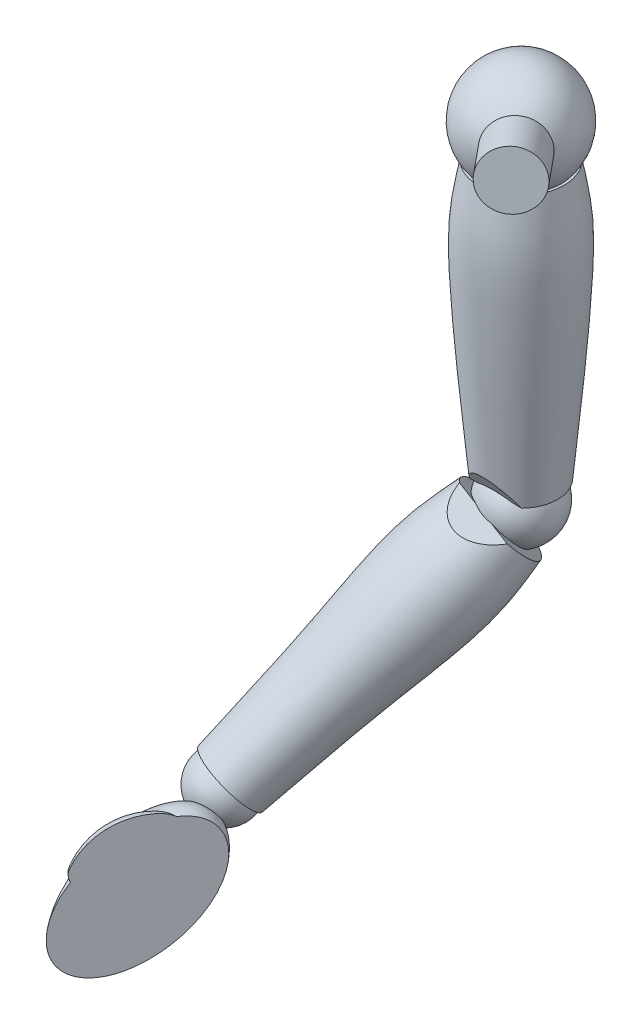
ISO-10303-21;
HEADER;
FILE_DESCRIPTION(('STEP AP214'),'2;1');
FILE_NAME('part.step','',(''),(''),'','','');
FILE_SCHEMA(('AUTOMOTIVE_DESIGN { 1 0 10303 214 1 1 1 1 }'));
ENDSEC;
DATA;
#1=APPLICATION_CONTEXT('core data for automotive mechanical design processes');
#2=APPLICATION_PROTOCOL_DEFINITION('international standard','automotive_design',2000,#1);
#3=PRODUCT_CONTEXT('',#1,'mechanical');
#4=PRODUCT('Part','Part','',(#3));
#5=PRODUCT_RELATED_PRODUCT_CATEGORY('part','',(#4));
#6=PRODUCT_DEFINITION_FORMATION('','',#4);
#7=PRODUCT_DEFINITION_CONTEXT('part definition',#1,'design');
#8=PRODUCT_DEFINITION('design','',#6,#7);
#9=PRODUCT_DEFINITION_SHAPE('','',#8);
#10=(LENGTH_UNIT() NAMED_UNIT(*) SI_UNIT(.MILLI.,.METRE.));
#11=(NAMED_UNIT(*) PLANE_ANGLE_UNIT() SI_UNIT($,.RADIAN.));
#12=(NAMED_UNIT(*) SI_UNIT($,.STERADIAN.) SOLID_ANGLE_UNIT());
#13=UNCERTAINTY_MEASURE_WITH_UNIT(LENGTH_MEASURE(1.E-05),#10,'distance_accuracy_value','');
#14=(GEOMETRIC_REPRESENTATION_CONTEXT(3) GLOBAL_UNCERTAINTY_ASSIGNED_CONTEXT((#13)) GLOBAL_UNIT_ASSIGNED_CONTEXT((#10,
#11,#12)) REPRESENTATION_CONTEXT('',''));
#15=CARTESIAN_POINT('',(0.,0.,0.));
#16=DIRECTION('',(0.,0.,1.));
#17=DIRECTION('',(1.,0.,0.));
#18=AXIS2_PLACEMENT_3D('',#15,#16,#17);
#19=CARTESIAN_POINT('',(21.107580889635,-54.1752539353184,-42.5276127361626));
#20=DIRECTION('',(0.,1.,0.));
#21=DIRECTION('',(0.,0.,1.));
#22=AXIS2_PLACEMENT_3D('',#19,#20,#21);
#23=PLANE('',#22);
#24=CARTESIAN_POINT('',(21.1075808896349,-54.1752539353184,-42.5276127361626));
#25=DIRECTION('',(0.,1.,0.));
#26=DIRECTION('',(0.,0.,1.));
#27=AXIS2_PLACEMENT_3D('',#24,#25,#26);
#28=CIRCLE('',#27,34.1376);
#29=CARTESIAN_POINT('',(45.6056142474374,-54.1752539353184,-18.7532127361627));
#30=VERTEX_POINT('',#29);
#31=CARTESIAN_POINT('',(-3.39045246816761,-54.1752539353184,-18.7532127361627));
#32=VERTEX_POINT('',#31);
#33=EDGE_CURVE('E42',#30,#32,#28,.T.);
#34=ORIENTED_EDGE('',*,*,#33,.F.);
#35=DIRECTION('',(1.,0.,0.));
#36=VECTOR('',#35,1.);
#37=CARTESIAN_POINT('',(-24.6124191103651,-54.1752539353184,-18.7532127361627));
#38=LINE('',#37,#36);
#39=CARTESIAN_POINT('',(37.7771037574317,-54.1752539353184,-18.7532127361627));
#40=VERTEX_POINT('',#39);
#41=EDGE_CURVE('E205',#40,#30,#38,.T.);
#42=ORIENTED_EDGE('',*,*,#41,.F.);
#43=CARTESIAN_POINT('',(21.1075808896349,-54.1752539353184,-42.5276127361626));
#44=DIRECTION('',(0.,1.,0.));
#45=DIRECTION('',(0.,0.,1.));
#46=AXIS2_PLACEMENT_3D('',#43,#44,#45);
#47=CIRCLE('',#46,29.0360997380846);
#48=CARTESIAN_POINT('',(4.43805802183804,-54.1752539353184,-18.7532127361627));
#49=VERTEX_POINT('',#48);
#50=EDGE_CURVE('E55',#49,#40,#47,.F.);
#51=ORIENTED_EDGE('',*,*,#50,.F.);
#52=EDGE_CURVE('E209',#32,#49,#38,.T.);
#53=ORIENTED_EDGE('',*,*,#52,.F.);
#54=EDGE_LOOP('',(#34,#42,#51,#53));
#55=FACE_BOUND('',#54,.T.);
#56=ADVANCED_FACE('F34',(#55),#23,.F.);
#57=CARTESIAN_POINT('',(21.1075808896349,203.380746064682,-42.5276127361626));
#58=DIRECTION('',(0.,-1.,0.));
#59=DIRECTION('',(0.,0.,-1.));
#60=AXIS2_PLACEMENT_3D('',#57,#58,#59);
#61=PLANE('',#60);
#62=CARTESIAN_POINT('',(21.1075808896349,203.380746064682,-42.5276127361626));
#63=DIRECTION('',(0.,1.,0.));
#64=DIRECTION('',(0.,0.,1.));
#65=AXIS2_PLACEMENT_3D('',#62,#63,#64);
#66=CIRCLE('',#65,40.2336);
#67=CARTESIAN_POINT('',(21.1075808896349,203.380746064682,-2.29401273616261));
#68=VERTEX_POINT('',#67);
#69=EDGE_CURVE('E243',#68,#68,#66,.T.);
#70=ORIENTED_EDGE('',*,*,#69,.T.);
#71=EDGE_LOOP('',(#70));
#72=FACE_BOUND('',#71,.T.);
#73=CARTESIAN_POINT('',(21.1075808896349,203.380746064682,-42.5276127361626));
#74=DIRECTION('',(0.,-1.,0.));
#75=DIRECTION('',(0.,0.,-1.));
#76=AXIS2_PLACEMENT_3D('',#73,#74,#75);
#77=CIRCLE('',#76,37.8016518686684);
#78=CARTESIAN_POINT('',(21.1075808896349,203.380746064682,-80.329264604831));
#79=VERTEX_POINT('',#78);
#80=EDGE_CURVE('E246',#79,#79,#77,.F.);
#81=ORIENTED_EDGE('',*,*,#80,.F.);
#82=EDGE_LOOP('',(#81));
#83=FACE_BOUND('',#82,.T.);
#84=ADVANCED_FACE('F36',(#72,#83),#61,.F.);
#85=CARTESIAN_POINT('',(55.245180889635,-54.1752539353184,-42.5276127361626));
#86=CARTESIAN_POINT('',(57.3234821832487,-32.2831213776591,-42.5276127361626));
#87=CARTESIAN_POINT('',(62.4667003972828,21.8938236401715,-42.5276127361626));
#88=CARTESIAN_POINT('',(68.0713493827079,92.5957984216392,-42.5276127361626));
#89=CARTESIAN_POINT('',(70.2445436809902,157.106375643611,-42.5276127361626));
#90=CARTESIAN_POINT('',(64.2170061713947,188.433921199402,-42.5276127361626));
#91=CARTESIAN_POINT('',(61.3411808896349,203.380746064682,-42.5276127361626));
#92=B_SPLINE_CURVE_WITH_KNOTS('',3,(#85,#86,#87,#88,#89,#90,#91),.UNSPECIFIED.,.F.,.F.,(4,1,1,1,
4),(0.,0.255009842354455,0.631078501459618,0.823982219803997,1.),.UNSPECIFIED.);
#93=CARTESIAN_POINT('',(21.1075808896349,280.476430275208,-42.5276127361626));
#94=DIRECTION('',(0.,1.,0.));
#95=AXIS1_PLACEMENT('',#93,#94);
#96=SURFACE_OF_REVOLUTION('',#92,#95);
#97=ORIENTED_EDGE('',*,*,#69,.F.);
#98=EDGE_LOOP('',(#97));
#99=FACE_BOUND('',#98,.T.);
#100=ORIENTED_EDGE('',*,*,#33,.T.);
#101=CARTESIAN_POINT('',(-3.39045246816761,-54.1752539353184,-18.7532127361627));
#102=CARTESIAN_POINT('',(-3.11818270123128,-53.6169479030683,-18.3965912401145));
#103=CARTESIAN_POINT('',(-2.83555788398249,-53.0621735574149,-18.0422256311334));
#104=CARTESIAN_POINT('',(-2.2470172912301,-51.9582748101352,-17.3371033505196));
#105=CARTESIAN_POINT('',(-1.94099620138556,-51.409190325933,-16.986372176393));
#106=CARTESIAN_POINT('',(-1.3048102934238,-50.3191637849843,-16.2901108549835));
#107=CARTESIAN_POINT('',(-0.97458211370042,-49.7782479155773,-15.9445974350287));
#108=CARTESIAN_POINT('',(-0.289017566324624,-48.7071379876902,-15.2604192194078));
#109=CARTESIAN_POINT('',(0.0663427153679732,-48.1769547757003,-14.9217613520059));
#110=CARTESIAN_POINT('',(0.809997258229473,-47.1203404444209,-14.2468422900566));
#111=CARTESIAN_POINT('',(1.19876719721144,-46.5941463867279,-13.910732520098));
#112=CARTESIAN_POINT('',(2.00487866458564,-45.5583488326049,-13.2491103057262));
#113=CARTESIAN_POINT('',(2.4221868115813,-45.0487269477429,-12.9235861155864));
#114=CARTESIAN_POINT('',(3.2870333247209,-44.0490616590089,-12.2850436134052));
#115=CARTESIAN_POINT('',(3.73452924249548,-43.5589922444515,-11.9720086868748));
#116=CARTESIAN_POINT('',(4.66187861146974,-42.6016010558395,-11.3604690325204));
#117=CARTESIAN_POINT('',(5.14170560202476,-42.1342612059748,-11.0619527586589));
#118=CARTESIAN_POINT('',(5.91638533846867,-41.4268157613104,-10.610067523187));
#119=CARTESIAN_POINT('',(6.19940129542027,-41.1774609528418,-10.4507905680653));
#120=CARTESIAN_POINT('',(6.7765339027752,-40.687996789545,-10.1381422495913));
#121=CARTESIAN_POINT('',(7.07065103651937,-40.4478878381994,-9.98477114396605));
#122=CARTESIAN_POINT('',(7.67024694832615,-39.9779277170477,-9.68458115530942));
#123=CARTESIAN_POINT('',(7.97572623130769,-39.7480770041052,-9.53776256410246));
#124=CARTESIAN_POINT('',(8.59745697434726,-39.3003311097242,-9.25176205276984));
#125=CARTESIAN_POINT('',(8.91367902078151,-39.0824069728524,-9.11256163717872));
#126=CARTESIAN_POINT('',(9.5577694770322,-38.6591063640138,-8.84217570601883));
#127=CARTESIAN_POINT('',(9.88563795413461,-38.4537299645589,-8.71099023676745));
#128=CARTESIAN_POINT('',(10.5530321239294,-38.0568706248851,-8.45749383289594));
#129=CARTESIAN_POINT('',(10.89255845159,-37.8653884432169,-8.33518338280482));
#130=CARTESIAN_POINT('',(11.7632138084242,-37.4019162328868,-8.03913758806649));
#131=CARTESIAN_POINT('',(12.3019701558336,-37.1399843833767,-7.8718269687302));
#132=CARTESIAN_POINT('',(13.4049124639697,-36.6571555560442,-7.56341701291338));
#133=CARTESIAN_POINT('',(13.9690941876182,-36.4362517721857,-7.42231332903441));
#134=CARTESIAN_POINT('',(14.8318440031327,-36.1400787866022,-7.23313096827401));
#135=CARTESIAN_POINT('',(15.1220401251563,-36.047251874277,-7.17383719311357));
#136=CARTESIAN_POINT('',(15.7075404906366,-35.8739306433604,-7.06312716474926));
#137=CARTESIAN_POINT('',(16.0028437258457,-35.7934339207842,-7.0117093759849));
#138=CARTESIAN_POINT('',(16.5979852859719,-35.6454076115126,-6.91715663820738));
#139=CARTESIAN_POINT('',(16.8978234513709,-35.5778775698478,-6.87402139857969));
#140=CARTESIAN_POINT('',(17.5013167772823,-35.4563604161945,-6.79640155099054));
#141=CARTESIAN_POINT('',(17.8049716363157,-35.4023722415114,-6.76191626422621));
#142=CARTESIAN_POINT('',(18.472512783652,-35.2996233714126,-6.69628477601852));
#143=CARTESIAN_POINT('',(18.8370284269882,-35.2537354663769,-6.6669735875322));
#144=CARTESIAN_POINT('',(19.5688525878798,-35.1823589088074,-6.62138136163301));
#145=CARTESIAN_POINT('',(19.9361610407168,-35.1568697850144,-6.60510002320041));
#146=CARTESIAN_POINT('',(20.6719619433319,-35.1266425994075,-6.58579221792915));
#147=CARTESIAN_POINT('',(21.0404543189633,-35.1219032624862,-6.5827649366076));
#148=CARTESIAN_POINT('',(21.7769696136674,-35.1332393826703,-6.59000595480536));
#149=CARTESIAN_POINT('',(22.1449925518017,-35.1493139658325,-6.60027369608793));
#150=CARTESIAN_POINT('',(22.8789713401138,-35.2020527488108,-6.63396092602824));
#151=CARTESIAN_POINT('',(23.2449270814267,-35.2387180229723,-6.65738110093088));
#152=CARTESIAN_POINT('',(23.9731348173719,-35.3321248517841,-6.71704530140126));
#153=CARTESIAN_POINT('',(24.3353873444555,-35.3888634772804,-6.75328745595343));
#154=CARTESIAN_POINT('',(25.1526853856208,-35.5397483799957,-6.84966613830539));
#155=CARTESIAN_POINT('',(25.6061870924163,-35.6398706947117,-6.91361989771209));
#156=CARTESIAN_POINT('',(26.5026646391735,-35.8694890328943,-7.0602900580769));
#157=CARTESIAN_POINT('',(26.9456383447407,-35.998990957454,-7.14301022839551));
#158=CARTESIAN_POINT('',(27.6006103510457,-36.2135074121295,-7.28003396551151));
#159=CARTESIAN_POINT('',(27.8173621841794,-36.2883938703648,-7.32786816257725));
#160=CARTESIAN_POINT('',(28.2475051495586,-36.4446101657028,-7.42765230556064));
#161=CARTESIAN_POINT('',(28.4608971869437,-36.5259382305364,-7.47960111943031));
#162=CARTESIAN_POINT('',(29.0959727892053,-36.7791981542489,-7.64137249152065));
#163=CARTESIAN_POINT('',(29.5124899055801,-36.9603839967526,-7.75710609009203));
#164=CARTESIAN_POINT('',(30.5508101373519,-37.4484151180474,-8.06883904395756));
#165=CARTESIAN_POINT('',(31.1625899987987,-37.770448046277,-8.27453960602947));
#166=CARTESIAN_POINT('',(32.3499958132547,-38.4588468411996,-8.7142586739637));
#167=CARTESIAN_POINT('',(32.9256046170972,-38.825233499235,-8.94829046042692));
#168=CARTESIAN_POINT('',(34.042132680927,-39.5959595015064,-9.44059655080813));
#169=CARTESIAN_POINT('',(34.582959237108,-40.0003937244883,-9.69893145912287));
#170=CARTESIAN_POINT('',(35.6294140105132,-40.8401891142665,-10.2353560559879));
#171=CARTESIAN_POINT('',(36.1350437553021,-41.2755489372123,-10.5134448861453));
#172=CARTESIAN_POINT('',(37.1590266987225,-42.214501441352,-11.1132067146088));
#173=CARTESIAN_POINT('',(37.6740642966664,-42.7206538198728,-11.4365147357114));
#174=CARTESIAN_POINT('',(38.6666713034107,-43.758761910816,-12.099612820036));
#175=CARTESIAN_POINT('',(39.1442187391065,-44.2907324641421,-12.4394123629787));
#176=CARTESIAN_POINT('',(40.0640902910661,-45.3760323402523,-13.1326544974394));
#177=CARTESIAN_POINT('',(40.5064041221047,-45.9293678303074,-13.4861010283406));
#178=CARTESIAN_POINT('',(41.3581788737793,-47.0540553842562,-14.2045022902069));
#179=CARTESIAN_POINT('',(41.7676226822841,-47.6254166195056,-14.5694628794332));
#180=CARTESIAN_POINT('',(42.5553783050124,-48.7828499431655,-15.3087807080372));
#181=CARTESIAN_POINT('',(42.9337016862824,-49.3689164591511,-15.6831343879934));
#182=CARTESIAN_POINT('',(43.6612057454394,-50.5535274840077,-16.4398121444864));
#183=CARTESIAN_POINT('',(44.0103945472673,-51.1520684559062,-16.8221339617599));
#184=CARTESIAN_POINT('',(44.5678011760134,-52.1553523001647,-17.4629878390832));
#185=CARTESIAN_POINT('',(44.7837118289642,-52.5570804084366,-17.7195941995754));
#186=CARTESIAN_POINT('',(45.2034323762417,-53.3636637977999,-18.2348044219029));
#187=CARTESIAN_POINT('',(45.4072744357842,-53.7685071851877,-18.4934006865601));
#188=CARTESIAN_POINT('',(45.6056142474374,-54.1752539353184,-18.7532127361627));
#189=B_SPLINE_CURVE_WITH_KNOTS('',3,(#101,#102,#103,#104,#105,#106,#107,#108,#109,#110,#111,
#112,#113,#114,#115,#116,#117,#118,#119,#120,#121,#122,#123,#124,#125,#126,#127,#128,#129,#130,
#131,#132,#133,#134,#135,#136,#137,#138,#139,#140,#141,#142,#143,#144,#145,#146,#147,#148,#149,
#150,#151,#152,#153,#154,#155,#156,#157,#158,#159,#160,#161,#162,#163,#164,#165,#166,#167,#168,
#169,#170,#171,#172,#173,#174,#175,#176,#177,#178,#179,#180,#181,#182,#183,#184,#185,#186,#187,
#188),.UNSPECIFIED.,.F.,.F.,(4,2,2,2,2,2,2,2,2,2,2,2,2,2,2,2,2,2,2,2,2,2,2,2,2,2,2,2,2,2,2,2,2,
2,2,2,2,2,2,2,2,2,2,4),(0.,2.14875496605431,4.30782702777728,6.4727674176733,8.63979628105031,
10.8456171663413,13.048900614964,15.2491480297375,17.4476160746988,18.675700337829,
19.9038381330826,21.1320305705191,22.3570952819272,23.5821670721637,24.8073056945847,
26.6710157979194,28.5344164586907,29.465285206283,30.395972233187,31.3266265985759,
32.257207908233,33.3620764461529,34.4669194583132,35.5716945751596,36.6764233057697,
37.7812096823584,38.8858349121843,40.2907338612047,41.6959152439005,42.3985672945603,
43.1010266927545,44.5061574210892,46.6667201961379,48.8282997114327,50.9954201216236,
53.1624464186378,55.5343238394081,57.9075812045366,60.2815288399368,62.6567044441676,
65.0309932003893,67.4046176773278,68.974397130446,70.5397846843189),.UNSPECIFIED.);
#190=EDGE_CURVE('E48',#32,#30,#189,.T.);
#191=ORIENTED_EDGE('',*,*,#190,.T.);
#192=EDGE_LOOP('',(#100,#191));
#193=FACE_BOUND('',#192,.T.);
#194=ADVANCED_FACE('F220',(#99,#193),#96,.T.);
#195=CARTESIAN_POINT('',(-24.6124191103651,-35.125253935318,-6.58490519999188));
#196=DIRECTION('',(0.,0.538309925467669,-0.842746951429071));
#197=DIRECTION('',(0.,0.842746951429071,0.538309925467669));
#198=AXIS2_PLACEMENT_3D('',#195,#196,#197);
#199=PLANE('',#198);
#200=ORIENTED_EDGE('',*,*,#52,.T.);
#201=CARTESIAN_POINT('',(21.1075808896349,-76.86689433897,-33.2476410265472));
#202=DIRECTION('',(0.,0.538309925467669,-0.842746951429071));
#203=DIRECTION('',(0.,0.842746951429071,0.538309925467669));
#204=AXIS2_PLACEMENT_3D('',#201,#202,#203);
#205=CIRCLE('',#204,31.6681541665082);
#206=EDGE_CURVE('E11',#49,#40,#205,.T.);
#207=ORIENTED_EDGE('',*,*,#206,.T.);
#208=ORIENTED_EDGE('',*,*,#41,.T.);
#209=ORIENTED_EDGE('',*,*,#190,.F.);
#210=EDGE_LOOP('',(#200,#207,#208,#209));
#211=FACE_BOUND('',#210,.T.);
#212=ADVANCED_FACE('F222',(#211),#199,.F.);
#213=CARTESIAN_POINT('',(21.1075808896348,-70.9392539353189,-42.5276127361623));
#214=DIRECTION('',(-0.35610546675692,-0.686277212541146,0.634202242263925));
#215=DIRECTION('',(0.147449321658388,0.628922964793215,0.763357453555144));
#216=AXIS2_PLACEMENT_3D('',#213,#214,#215);
#217=SPHERICAL_SURFACE('',#216,33.528);
#218=CARTESIAN_POINT('',(14.2152308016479,-84.2220121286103,-30.2527551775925));
#219=DIRECTION('',(-0.35610546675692,-0.686277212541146,0.634202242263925));
#220=DIRECTION('',(-0.147449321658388,-0.628922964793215,-0.763357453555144));
#221=AXIS2_PLACEMENT_3D('',#218,#219,#220);
#222=CIRCLE('',#221,27.377335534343);
#223=CARTESIAN_POINT('',(9.87059005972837,-64.6951297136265,-11.5620232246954));
#224=VERTEX_POINT('',#223);
#225=CARTESIAN_POINT('',(26.2001055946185,-71.1606221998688,-9.38935731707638));
#226=VERTEX_POINT('',#225);
#227=EDGE_CURVE('E166',#224,#226,#222,.T.);
#228=ORIENTED_EDGE('',*,*,#227,.F.);
#229=CARTESIAN_POINT('',(23.8046308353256,-63.6070350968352,-40.978876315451));
#230=DIRECTION('',(-0.338631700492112,-0.920606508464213,-0.194453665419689));
#231=DIRECTION('',(0.184067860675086,0.137855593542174,-0.973198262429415));
#232=AXIS2_PLACEMENT_3D('',#229,#230,#231);
#233=CIRCLE('',#232,32.5682773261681);
#234=EDGE_CURVE('E201',#226,#224,#233,.T.);
#235=ORIENTED_EDGE('',*,*,#234,.F.);
#236=EDGE_LOOP('',(#228,#235));
#237=FACE_BOUND('',#236,.T.);
#238=ORIENTED_EDGE('',*,*,#50,.T.);
#239=ORIENTED_EDGE('',*,*,#206,.F.);
#240=EDGE_LOOP('',(#238,#239));
#241=FACE_BOUND('',#240,.T.);
#242=ADVANCED_FACE('F225',(#237,#241),#217,.T.);
#243=CARTESIAN_POINT('',(-76.5792707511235,-259.198818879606,131.446746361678));
#244=DIRECTION('',(0.35610546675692,0.686277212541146,-0.634202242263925));
#245=DIRECTION('',(0.147449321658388,0.628922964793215,0.763357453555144));
#246=AXIS2_PLACEMENT_3D('',#243,#244,#245);
#247=PLANE('',#246);
#248=CARTESIAN_POINT('',(-76.5792707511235,-259.198818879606,131.446746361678));
#249=DIRECTION('',(0.35610546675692,0.686277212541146,-0.634202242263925));
#250=DIRECTION('',(0.147449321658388,0.628922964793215,0.763357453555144));
#251=AXIS2_PLACEMENT_3D('',#248,#249,#250);
#252=CIRCLE('',#251,30.4800000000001);
#253=CARTESIAN_POINT('',(-72.0850154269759,-240.029246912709,154.713881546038));
#254=VERTEX_POINT('',#253);
#255=EDGE_CURVE('E202',#254,#254,#252,.T.);
#256=ORIENTED_EDGE('',*,*,#255,.F.);
#257=EDGE_LOOP('',(#256));
#258=FACE_BOUND('',#257,.T.);
#259=CARTESIAN_POINT('',(-76.5792707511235,-259.198818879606,131.446746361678));
#260=DIRECTION('',(0.35610546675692,0.686277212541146,-0.634202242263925));
#261=DIRECTION('',(0.147449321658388,0.628922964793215,0.763357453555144));
#262=AXIS2_PLACEMENT_3D('',#259,#260,#261);
#263=CIRCLE('',#262,28.2462618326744);
#264=CARTESIAN_POINT('',(-72.4143786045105,-241.434096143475,153.00874086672));
#265=VERTEX_POINT('',#264);
#266=EDGE_CURVE('E110',#265,#265,#263,.F.);
#267=ORIENTED_EDGE('',*,*,#266,.F.);
#268=EDGE_LOOP('',(#267));
#269=FACE_BOUND('',#268,.T.);
#270=ADVANCED_FACE('F192',(#258,#269),#247,.F.);
#271=CARTESIAN_POINT('',(14.2152308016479,-84.2220121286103,-30.2527551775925));
#272=DIRECTION('',(-0.35610546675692,-0.686277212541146,0.634202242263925));
#273=DIRECTION('',(-0.147449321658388,-0.628922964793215,-0.763357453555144));
#274=AXIS2_PLACEMENT_3D('',#271,#272,#273);
#275=PLANE('',#274);
#276=DIRECTION('',(0.922739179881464,-0.365348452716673,0.122771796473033));
#277=VECTOR('',#276,1.);
#278=CARTESIAN_POINT('',(-24.1522874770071,-51.2241446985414,-16.0888168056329));
#279=LINE('',#278,#277);
#280=CARTESIAN_POINT('',(-7.74172312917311,-57.7217275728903,-13.9053672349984));
#281=VERTEX_POINT('',#280);
#282=EDGE_CURVE('E170',#281,#224,#279,.T.);
#283=ORIENTED_EDGE('',*,*,#282,.T.);
#284=ORIENTED_EDGE('',*,*,#227,.T.);
#285=CARTESIAN_POINT('',(43.81241878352,-78.1340243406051,-7.04601330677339));
#286=VERTEX_POINT('',#285);
#287=EDGE_CURVE('E169',#226,#286,#279,.T.);
#288=ORIENTED_EDGE('',*,*,#287,.T.);
#289=CARTESIAN_POINT('',(14.2152308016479,-84.2220121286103,-30.2527551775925));
#290=DIRECTION('',(0.35610546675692,0.686277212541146,-0.634202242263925));
#291=DIRECTION('',(0.147449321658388,0.628922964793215,0.763357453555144));
#292=AXIS2_PLACEMENT_3D('',#289,#290,#291);
#293=CIRCLE('',#292,38.1);
#294=EDGE_CURVE('E173',#286,#281,#293,.T.);
#295=ORIENTED_EDGE('',*,*,#294,.T.);
#296=EDGE_LOOP('',(#283,#284,#288,#295));
#297=FACE_BOUND('',#296,.T.);
#298=ADVANCED_FACE('F189',(#297),#275,.F.);
#299=CARTESIAN_POINT('',(-48.4541805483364,-270.33463971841,135.188830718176));
#300=CARTESIAN_POINT('',(-40.8436515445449,-257.964481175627,123.527132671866));
#301=CARTESIAN_POINT('',(-22.799075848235,-228.63481669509,95.8772290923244));
#302=CARTESIAN_POINT('',(8.12477792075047,-181.063937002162,50.7108135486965));
#303=CARTESIAN_POINT('',(39.1646351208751,-137.942055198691,9.18747806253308));
#304=CARTESIAN_POINT('',(46.9863433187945,-107.442658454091,-17.4515185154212));
#305=CARTESIAN_POINT('',(49.3715935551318,-98.1417881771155,-25.57514973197));
#306=B_SPLINE_CURVE_WITH_KNOTS('',3,(#299,#300,#301,#302,#303,#304,#305),.UNSPECIFIED.,.F.,.F.,
(4,1,1,1,4),(0.,0.218353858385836,0.517717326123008,0.852926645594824,1.),.UNSPECIFIED.);
#307=CARTESIAN_POINT('',(94.4969704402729,70.4948727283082,-173.229665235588));
#308=DIRECTION('',(0.35610546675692,0.686277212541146,-0.634202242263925));
#309=AXIS1_PLACEMENT('',#307,#308);
#310=SURFACE_OF_REVOLUTION('',#306,#309);
#311=ORIENTED_EDGE('',*,*,#294,.F.);
#312=CARTESIAN_POINT('',(43.81241878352,-78.1340243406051,-7.04601330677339));
#313=CARTESIAN_POINT('',(43.5864362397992,-78.131284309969,-6.66544777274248));
#314=CARTESIAN_POINT('',(43.3568988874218,-78.1267858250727,-6.28701680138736));
#315=CARTESIAN_POINT('',(42.8905348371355,-78.1141452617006,-5.53471076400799));
#316=CARTESIAN_POINT('',(42.6537077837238,-78.1060030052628,-5.16083592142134));
#317=CARTESIAN_POINT('',(41.9307069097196,-78.0758649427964,-4.044448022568));
#318=CARTESIAN_POINT('',(41.4332788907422,-78.0481717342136,-3.30930966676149));
#319=CARTESIAN_POINT('',(40.4067604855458,-77.9764687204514,-1.86114250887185));
#320=CARTESIAN_POINT('',(39.8776381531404,-77.9324422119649,-1.14813715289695));
#321=CARTESIAN_POINT('',(38.7788155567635,-77.826047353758,0.261701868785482));
#322=CARTESIAN_POINT('',(38.2086298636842,-77.7634166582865,0.958138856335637));
#323=CARTESIAN_POINT('',(37.0340698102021,-77.6187088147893,2.31848495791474));
#324=CARTESIAN_POINT('',(36.4297259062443,-77.5366487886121,2.98242209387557));
#325=CARTESIAN_POINT('',(35.1857506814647,-77.3515783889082,4.27256198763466));
#326=CARTESIAN_POINT('',(34.5461432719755,-77.2485820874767,4.89878972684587));
#327=CARTESIAN_POINT('',(33.2849280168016,-77.0294319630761,6.05760787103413));
#328=CARTESIAN_POINT('',(32.666205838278,-76.9150706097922,6.59365915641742));
#329=CARTESIAN_POINT('',(31.7152341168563,-76.7283445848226,7.36570928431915));
#330=CARTESIAN_POINT('',(31.3944205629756,-76.6635701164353,7.61772737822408));
#331=CARTESIAN_POINT('',(30.7450828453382,-76.5287809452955,8.11038225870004));
#332=CARTESIAN_POINT('',(30.4165562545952,-76.4587645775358,8.35101538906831));
#333=CARTESIAN_POINT('',(29.4225340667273,-76.2412818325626,9.05242357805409));
#334=CARTESIAN_POINT('',(28.7457687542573,-76.0858294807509,9.49501611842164));
#335=CARTESIAN_POINT('',(27.3639787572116,-75.7526340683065,10.3238821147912));
#336=CARTESIAN_POINT('',(26.6589631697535,-75.5748981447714,10.7101735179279));
#337=CARTESIAN_POINT('',(25.3527717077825,-75.2305640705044,11.354654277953));
#338=CARTESIAN_POINT('',(24.7558022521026,-75.0677391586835,11.6233820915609));
#339=CARTESIAN_POINT('',(23.5468764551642,-74.7264995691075,12.1131296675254));
#340=CARTESIAN_POINT('',(22.934921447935,-74.5480862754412,12.3341536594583));
#341=CARTESIAN_POINT('',(21.6990237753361,-74.1758263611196,12.7240112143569));
#342=CARTESIAN_POINT('',(21.0750794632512,-73.9819776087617,12.8928375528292));
#343=CARTESIAN_POINT('',(19.8191520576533,-73.5794095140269,13.1740872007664));
#344=CARTESIAN_POINT('',(19.1871689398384,-73.3706901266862,13.2865103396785));
#345=CARTESIAN_POINT('',(18.1283331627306,-73.0103363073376,13.4243904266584));
#346=CARTESIAN_POINT('',(17.7022784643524,-72.8624669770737,13.4662829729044));
#347=CARTESIAN_POINT('',(16.8503347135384,-72.5609286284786,13.5223220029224));
#348=CARTESIAN_POINT('',(16.4244456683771,-72.4072593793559,13.5364673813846));
#349=CARTESIAN_POINT('',(15.5746085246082,-72.0946608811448,13.5364755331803));
#350=CARTESIAN_POINT('',(15.1506603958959,-71.9357317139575,13.5223387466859));
#351=CARTESIAN_POINT('',(14.3066383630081,-71.6132801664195,13.4655726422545));
#352=CARTESIAN_POINT('',(13.8865628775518,-71.4497597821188,13.4229555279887));
#353=CARTESIAN_POINT('',(13.0518488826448,-71.1187205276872,13.3093229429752));
#354=CARTESIAN_POINT('',(12.6372104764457,-70.9512015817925,13.2383069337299));
#355=CARTESIAN_POINT('',(11.8151511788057,-70.6129097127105,13.0683005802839));
#356=CARTESIAN_POINT('',(11.4077293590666,-70.4421372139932,12.9693138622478));
#357=CARTESIAN_POINT('',(10.4708079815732,-70.0421992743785,12.7074818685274));
#358=CARTESIAN_POINT('',(9.94457179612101,-69.8120588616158,12.5343377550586));
#359=CARTESIAN_POINT('',(8.91077094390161,-69.3490266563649,12.1425080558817));
#360=CARTESIAN_POINT('',(8.40320408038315,-69.116135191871,11.9238278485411));
#361=CARTESIAN_POINT('',(7.40917124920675,-68.6491044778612,11.4438138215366));
#362=CARTESIAN_POINT('',(6.92270877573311,-68.4149650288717,11.182472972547));
#363=CARTESIAN_POINT('',(5.9729179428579,-67.9468984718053,10.6205096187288));
#364=CARTESIAN_POINT('',(5.50959313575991,-67.7129714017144,10.3198811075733));
#365=CARTESIAN_POINT('',(4.46383810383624,-67.1723365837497,9.58147318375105));
#366=CARTESIAN_POINT('',(3.89042460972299,-66.8661571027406,9.13049255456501));
#367=CARTESIAN_POINT('',(2.787758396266,-66.2586406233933,8.17455331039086));
#368=CARTESIAN_POINT('',(2.25851771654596,-65.9573049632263,7.66958006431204));
#369=CARTESIAN_POINT('',(1.2436719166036,-65.3607567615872,6.61263316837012));
#370=CARTESIAN_POINT('',(0.758135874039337,-65.0655544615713,6.06058770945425));
#371=CARTESIAN_POINT('',(-0.169192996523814,-64.4829381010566,4.91719213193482));
#372=CARTESIAN_POINT('',(-0.610984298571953,-64.1955243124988,4.32584064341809));
#373=CARTESIAN_POINT('',(-1.43749564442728,-63.6392066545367,3.13138275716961));
#374=CARTESIAN_POINT('',(-1.82367499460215,-63.3700072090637,2.52941831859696));
#375=CARTESIAN_POINT('',(-2.55846646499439,-62.8398716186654,1.29918905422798));
#376=CARTESIAN_POINT('',(-2.90706300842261,-62.5789389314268,0.670913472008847));
#377=CARTESIAN_POINT('',(-3.56837939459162,-62.0656067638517,-0.60771628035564));
#378=CARTESIAN_POINT('',(-3.88109231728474,-61.8132089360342,-1.25807467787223));
#379=CARTESIAN_POINT('',(-4.47289992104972,-61.3166555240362,-2.57831457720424));
#380=CARTESIAN_POINT('',(-4.75194001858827,-61.0725137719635,-3.24822564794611));
#381=CARTESIAN_POINT('',(-5.27759978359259,-60.5929064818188,-4.60343040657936));
#382=CARTESIAN_POINT('',(-5.52422767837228,-60.3574387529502,-5.28872013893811));
#383=CARTESIAN_POINT('',(-5.98685693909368,-59.895054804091,-6.67214862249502));
#384=CARTESIAN_POINT('',(-6.20286496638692,-59.6681367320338,-7.37028454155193));
#385=CARTESIAN_POINT('',(-6.67872472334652,-59.1422570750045,-9.03128195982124));
#386=CARTESIAN_POINT('',(-6.926291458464,-58.8468290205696,-9.99880831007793));
#387=CARTESIAN_POINT('',(-7.25979089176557,-58.4157244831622,-11.4590233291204));
#388=CARTESIAN_POINT('',(-7.36441338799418,-58.2744004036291,-11.945902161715));
#389=CARTESIAN_POINT('',(-7.56183143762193,-57.9953684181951,-12.9231357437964));
#390=CARTESIAN_POINT('',(-7.65462587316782,-57.8576608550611,-13.4134908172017));
#391=CARTESIAN_POINT('',(-7.74172312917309,-57.7217275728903,-13.9053672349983));
#392=B_SPLINE_CURVE_WITH_KNOTS('',3,(#312,#313,#314,#315,#316,#317,#318,#319,#320,#321,#322,
#323,#324,#325,#326,#327,#328,#329,#330,#331,#332,#333,#334,#335,#336,#337,#338,#339,#340,#341,
#342,#343,#344,#345,#346,#347,#348,#349,#350,#351,#352,#353,#354,#355,#356,#357,#358,#359,#360,
#361,#362,#363,#364,#365,#366,#367,#368,#369,#370,#371,#372,#373,#374,#375,#376,#377,#378,#379,
#380,#381,#382,#383,#384,#385,#386,#387,#388,#389,#390,#391),.UNSPECIFIED.,.F.,.F.,(4,2,2,2,2,2,
2,2,2,2,2,2,2,2,2,2,2,2,2,2,2,2,2,2,2,2,2,2,2,2,2,2,2,2,2,2,2,2,2,4),(0.,1.32779136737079,
2.65564759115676,5.31880754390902,7.98469852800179,10.690127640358,13.3931814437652,
16.0944243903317,18.5722816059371,19.81127165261,21.0506569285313,23.5183789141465,
25.9853125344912,28.007293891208,30.0290958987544,32.0511776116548,34.0732654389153,
35.4312457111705,36.7892800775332,38.147293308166,39.5047250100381,40.8621824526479,
42.2194639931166,44.0169542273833,45.8142322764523,47.6118067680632,49.4096563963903,
51.7796212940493,54.150230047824,56.5245222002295,58.8988971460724,61.1898953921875,
63.4818395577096,65.7742249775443,68.0702778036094,70.3657466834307,72.6607154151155,
75.7833933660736,77.3362397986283,78.8892328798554),.UNSPECIFIED.);
#393=EDGE_CURVE('E195',#286,#281,#392,.T.);
#394=ORIENTED_EDGE('',*,*,#393,.T.);
#395=EDGE_LOOP('',(#311,#394));
#396=FACE_BOUND('',#395,.T.);
#397=ORIENTED_EDGE('',*,*,#255,.T.);
#398=EDGE_LOOP('',(#397));
#399=FACE_BOUND('',#398,.T.);
#400=ADVANCED_FACE('F183',(#396,#399),#310,.T.);
#401=CARTESIAN_POINT('',(-24.1522874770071,-51.2241446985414,-16.0888168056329));
#402=DIRECTION('',(-0.338631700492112,-0.920606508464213,-0.194453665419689));
#403=DIRECTION('',(0.184067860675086,0.137855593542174,-0.973198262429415));
#404=AXIS2_PLACEMENT_3D('',#401,#402,#403);
#405=PLANE('',#404);
#406=ORIENTED_EDGE('',*,*,#287,.F.);
#407=ORIENTED_EDGE('',*,*,#234,.T.);
#408=ORIENTED_EDGE('',*,*,#282,.F.);
#409=ORIENTED_EDGE('',*,*,#393,.F.);
#410=EDGE_LOOP('',(#406,#407,#408,#409));
#411=FACE_BOUND('',#410,.T.);
#412=ADVANCED_FACE('F188',(#411),#405,.F.);
#413=CARTESIAN_POINT('',(-78.5872782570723,-263.068598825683,135.022885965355));
#414=DIRECTION('',(0.0389642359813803,0.568844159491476,-0.821521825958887));
#415=DIRECTION('',(0.886577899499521,0.359563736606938,0.291021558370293));
#416=AXIS2_PLACEMENT_3D('',#413,#414,#415);
#417=SPHERICAL_SURFACE('',#416,28.8036);
#418=CARTESIAN_POINT('',(-72.3268870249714,-262.146531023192,163.122791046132));
#419=CARTESIAN_POINT('',(-72.752366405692,-262.104678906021,163.216211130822));
#420=CARTESIAN_POINT('',(-73.181364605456,-262.078982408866,163.300715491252));
#421=CARTESIAN_POINT('',(-74.043449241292,-262.059808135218,163.451303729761));
#422=CARTESIAN_POINT('',(-74.4765369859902,-262.066341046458,163.51738148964));
#423=CARTESIAN_POINT('',(-75.3441007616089,-262.11139869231,163.630666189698));
#424=CARTESIAN_POINT('',(-75.7785778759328,-262.149966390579,163.677847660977));
#425=CARTESIAN_POINT('',(-76.6452476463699,-262.258671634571,163.752871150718));
#426=CARTESIAN_POINT('',(-77.0774402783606,-262.328809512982,163.780712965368));
#427=CARTESIAN_POINT('',(-77.9359775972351,-262.499896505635,163.816834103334));
#428=CARTESIAN_POINT('',(-78.3623285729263,-262.600809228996,163.825136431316));
#429=CARTESIAN_POINT('',(-79.2067272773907,-262.832650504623,163.82218595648));
#430=CARTESIAN_POINT('',(-79.6247748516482,-262.963579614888,163.810932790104));
#431=CARTESIAN_POINT('',(-80.4495106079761,-263.254418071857,163.768955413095));
#432=CARTESIAN_POINT('',(-80.8562023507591,-263.414318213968,163.738237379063));
#433=CARTESIAN_POINT('',(-81.655522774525,-263.761980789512,163.657551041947));
#434=CARTESIAN_POINT('',(-82.0481514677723,-263.949743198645,163.607582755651));
#435=CARTESIAN_POINT('',(-82.8188731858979,-264.35302749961,163.488392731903));
#436=CARTESIAN_POINT('',(-83.1968659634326,-264.56870772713,163.419058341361));
#437=CARTESIAN_POINT('',(-83.9331156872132,-265.025471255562,163.26175823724));
#438=CARTESIAN_POINT('',(-84.2913725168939,-265.266554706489,163.173792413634));
#439=CARTESIAN_POINT('',(-84.98555982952,-265.772506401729,162.979855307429));
#440=CARTESIAN_POINT('',(-85.3214888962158,-266.037376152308,162.873882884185));
#441=CARTESIAN_POINT('',(-85.9685009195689,-266.589097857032,162.644705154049));
#442=CARTESIAN_POINT('',(-86.279583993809,-266.875949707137,162.521499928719));
#443=CARTESIAN_POINT('',(-86.8737017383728,-267.46885182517,162.259132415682));
#444=CARTESIAN_POINT('',(-87.1568134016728,-267.774845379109,162.120016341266));
#445=CARTESIAN_POINT('',(-87.6937964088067,-268.404683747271,161.826573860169));
#446=CARTESIAN_POINT('',(-87.9476677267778,-268.728528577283,161.672247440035));
#447=CARTESIAN_POINT('',(-88.4241357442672,-269.391828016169,161.349548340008));
#448=CARTESIAN_POINT('',(-88.6467339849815,-269.731281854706,161.181176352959));
#449=CARTESIAN_POINT('',(-89.0588372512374,-270.42344557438,160.831660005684));
#450=CARTESIAN_POINT('',(-89.2483427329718,-270.776155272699,160.650515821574));
#451=CARTESIAN_POINT('',(-89.5899511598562,-271.486728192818,160.279775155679));
#452=CARTESIAN_POINT('',(-89.7425925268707,-271.844424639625,160.090355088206));
#453=CARTESIAN_POINT('',(-90.0129233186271,-272.567737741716,159.701928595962));
#454=CARTESIAN_POINT('',(-90.1306130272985,-272.933354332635,159.502922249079));
#455=CARTESIAN_POINT('',(-90.3299543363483,-273.669869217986,159.096870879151));
#456=CARTESIAN_POINT('',(-90.4116091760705,-274.040767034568,158.889826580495));
#457=CARTESIAN_POINT('',(-90.5380817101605,-274.785182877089,158.469294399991));
#458=CARTESIAN_POINT('',(-90.5828999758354,-275.158700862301,158.25580661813));
#459=CARTESIAN_POINT('',(-90.6346200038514,-275.897719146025,157.828621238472));
#460=CARTESIAN_POINT('',(-90.6423013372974,-276.263222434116,157.615022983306));
#461=CARTESIAN_POINT('',(-90.6216394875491,-276.99146982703,157.184883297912));
#462=CARTESIAN_POINT('',(-90.5932967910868,-277.354213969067,156.968341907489));
#463=CARTESIAN_POINT('',(-90.5006574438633,-278.074270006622,156.53398821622));
#464=CARTESIAN_POINT('',(-90.4363638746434,-278.431582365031,156.316176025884));
#465=CARTESIAN_POINT('',(-90.2721847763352,-279.138171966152,155.880931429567));
#466=CARTESIAN_POINT('',(-90.1722996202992,-279.487449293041,155.663499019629));
#467=CARTESIAN_POINT('',(-89.9396890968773,-280.16923766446,155.234538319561));
#468=CARTESIAN_POINT('',(-89.807580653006,-280.501936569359,155.022973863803));
#469=CARTESIAN_POINT('',(-89.5105659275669,-281.154676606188,154.603374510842));
#470=CARTESIAN_POINT('',(-89.3456600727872,-281.474717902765,154.395339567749));
#471=CARTESIAN_POINT('',(-88.9842276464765,-282.099813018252,153.984327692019));
#472=CARTESIAN_POINT('',(-88.7877027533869,-282.404867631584,153.78135049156));
#473=CARTESIAN_POINT('',(-88.3644507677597,-282.997803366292,153.381906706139));
#474=CARTESIAN_POINT('',(-88.1377237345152,-283.285684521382,153.185440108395));
#475=CARTESIAN_POINT('',(-87.6576296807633,-283.840014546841,152.801925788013));
#476=CARTESIAN_POINT('',(-87.4044858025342,-284.106613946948,152.614816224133));
#477=CARTESIAN_POINT('',(-86.8719576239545,-284.61899372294,152.249661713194));
#478=CARTESIAN_POINT('',(-86.5925735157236,-284.864774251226,152.071616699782));
#479=CARTESIAN_POINT('',(-86.0096048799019,-285.333809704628,151.725780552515));
#480=CARTESIAN_POINT('',(-85.7060204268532,-285.557064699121,151.557989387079));
#481=CARTESIAN_POINT('',(-85.0768599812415,-285.979524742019,151.233747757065));
#482=CARTESIAN_POINT('',(-84.7512838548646,-286.178729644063,151.077297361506));
#483=CARTESIAN_POINT('',(-84.0789122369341,-286.55263497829,150.77600773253));
#484=CARTESIAN_POINT('',(-83.7320237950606,-286.727215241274,150.631226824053));
#485=CARTESIAN_POINT('',(-83.0209387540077,-287.049598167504,150.354982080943));
#486=CARTESIAN_POINT('',(-82.6567421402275,-287.197400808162,150.223518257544));
#487=CARTESIAN_POINT('',(-81.9136301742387,-287.465291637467,149.974662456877));
#488=CARTESIAN_POINT('',(-81.5347141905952,-287.585378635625,149.857271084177));
#489=CARTESIAN_POINT('',(-80.7648513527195,-287.797097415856,149.637207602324));
#490=CARTESIAN_POINT('',(-80.373904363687,-287.888728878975,149.534535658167));
#491=CARTESIAN_POINT('',(-79.5765900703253,-288.044200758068,149.342968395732));
#492=CARTESIAN_POINT('',(-79.1700779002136,-288.107590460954,149.254310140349));
#493=CARTESIAN_POINT('',(-78.350323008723,-288.204151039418,149.093140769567));
#494=CARTESIAN_POINT('',(-77.9370802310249,-288.237321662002,149.020629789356));
#495=CARTESIAN_POINT('',(-77.1067041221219,-288.273322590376,148.892061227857));
#496=CARTESIAN_POINT('',(-76.6895705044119,-288.27615064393,148.836004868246));
#497=CARTESIAN_POINT('',(-75.8542928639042,-288.251542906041,148.740551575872));
#498=CARTESIAN_POINT('',(-75.4361488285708,-288.224106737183,148.701154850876));
#499=CARTESIAN_POINT('',(-74.5930460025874,-288.138370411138,148.638474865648));
#500=CARTESIAN_POINT('',(-74.1681247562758,-288.079444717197,148.615541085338));
#501=CARTESIAN_POINT('',(-73.3231024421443,-287.930851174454,148.587121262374));
#502=CARTESIAN_POINT('',(-72.9030014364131,-287.841182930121,148.581635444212));
#503=CARTESIAN_POINT('',(-72.0704583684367,-287.631786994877,148.588006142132));
#504=CARTESIAN_POINT('',(-71.658016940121,-287.512056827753,148.599864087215));
#505=CARTESIAN_POINT('',(-70.8436204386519,-287.24341724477,148.640725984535));
#506=CARTESIAN_POINT('',(-70.4416654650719,-287.094507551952,148.669730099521));
#507=CARTESIAN_POINT('',(-69.6437370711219,-286.765588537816,148.745282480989));
#508=CARTESIAN_POINT('',(-69.2480061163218,-286.585061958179,148.792140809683));
#509=CARTESIAN_POINT('',(-68.4729724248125,-286.19613670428,148.9029523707));
#510=CARTESIAN_POINT('',(-68.0936699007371,-285.987737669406,148.966905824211));
#511=CARTESIAN_POINT('',(-67.3541150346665,-285.54452084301,149.111442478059));
#512=CARTESIAN_POINT('',(-66.993863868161,-285.309701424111,149.192026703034));
#513=CARTESIAN_POINT('',(-66.2949627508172,-284.815290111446,149.369274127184));
#514=CARTESIAN_POINT('',(-65.9563128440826,-284.555698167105,149.465937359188));
#515=CARTESIAN_POINT('',(-65.3003791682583,-284.011353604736,149.675560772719));
#516=CARTESIAN_POINT('',(-64.9832896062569,-283.726415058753,149.788646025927));
#517=CARTESIAN_POINT('',(-64.3758208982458,-283.135198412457,150.0298048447));
#518=CARTESIAN_POINT('',(-64.0854419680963,-282.828920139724,150.157878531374));
#519=CARTESIAN_POINT('',(-63.5335699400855,-282.197194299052,150.428217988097));
#520=CARTESIAN_POINT('',(-63.2720769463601,-281.871746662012,150.570483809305));
#521=CARTESIAN_POINT('',(-62.7799946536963,-281.204013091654,150.868329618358));
#522=CARTESIAN_POINT('',(-62.5494050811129,-280.861727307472,151.023909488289));
#523=CARTESIAN_POINT('',(-62.1224904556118,-280.165282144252,151.346273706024));
#524=CARTESIAN_POINT('',(-61.9259336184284,-279.811224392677,151.512970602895));
#525=CARTESIAN_POINT('',(-61.5667105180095,-279.091525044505,151.85752018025));
#526=CARTESIAN_POINT('',(-61.4040442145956,-278.725883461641,152.035372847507));
#527=CARTESIAN_POINT('',(-61.1140201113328,-277.985751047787,152.401107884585));
#528=CARTESIAN_POINT('',(-60.986659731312,-277.611260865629,152.588989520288));
#529=CARTESIAN_POINT('',(-60.7684110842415,-276.856236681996,152.973590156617));
#530=CARTESIAN_POINT('',(-60.6775221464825,-276.475702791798,153.170308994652));
#531=CARTESIAN_POINT('',(-60.5346613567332,-275.719587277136,153.567057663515));
#532=CARTESIAN_POINT('',(-60.481909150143,-275.344070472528,153.766930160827));
#533=CARTESIAN_POINT('',(-60.4128457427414,-274.592882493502,154.172602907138));
#534=CARTESIAN_POINT('',(-60.3965341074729,-274.217211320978,154.378403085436));
#535=CARTESIAN_POINT('',(-60.40068420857,-273.468639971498,154.794524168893));
#536=CARTESIAN_POINT('',(-60.4211414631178,-273.095739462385,155.004844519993));
#537=CARTESIAN_POINT('',(-60.4988581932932,-272.355567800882,155.428571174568));
#538=CARTESIAN_POINT('',(-60.556116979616,-271.988296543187,155.64197742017));
#539=CARTESIAN_POINT('',(-60.7052072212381,-271.271655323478,156.064815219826));
#540=CARTESIAN_POINT('',(-60.7961075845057,-270.922068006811,156.274207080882));
#541=CARTESIAN_POINT('',(-61.0120215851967,-270.233606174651,156.693012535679));
#542=CARTESIAN_POINT('',(-61.1370346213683,-269.894731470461,156.902426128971));
#543=CARTESIAN_POINT('',(-61.4203146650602,-269.230289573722,157.319752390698));
#544=CARTESIAN_POINT('',(-61.5785770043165,-268.904720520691,157.527665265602));
#545=CARTESIAN_POINT('',(-61.9272385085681,-268.269277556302,157.940506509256));
#546=CARTESIAN_POINT('',(-62.1176373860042,-267.959403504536,158.145434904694));
#547=CARTESIAN_POINT('',(-62.5256547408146,-267.362775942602,158.547335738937));
#548=CARTESIAN_POINT('',(-62.7427539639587,-267.075718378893,158.744384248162));
#549=CARTESIAN_POINT('',(-63.2050620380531,-266.520998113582,159.132713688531));
#550=CARTESIAN_POINT('',(-63.4502706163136,-266.253335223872,159.323994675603));
#551=CARTESIAN_POINT('',(-63.9670599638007,-265.739171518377,159.699449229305));
#552=CARTESIAN_POINT('',(-64.2386471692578,-265.492675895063,159.883621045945));
#553=CARTESIAN_POINT('',(-64.8061413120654,-265.022553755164,160.243469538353));
#554=CARTESIAN_POINT('',(-65.1020479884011,-264.798926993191,160.419146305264));
#555=CARTESIAN_POINT('',(-65.7165737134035,-264.375575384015,160.761046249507));
#556=CARTESIAN_POINT('',(-66.0352329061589,-264.175894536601,160.92725173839));
#557=CARTESIAN_POINT('',(-66.6924749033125,-263.80210994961,161.248669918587));
#558=CARTESIAN_POINT('',(-67.0310580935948,-263.628006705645,161.403882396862));
#559=CARTESIAN_POINT('',(-67.7253543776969,-263.30653764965,161.702049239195));
#560=CARTESIAN_POINT('',(-68.0810490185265,-263.159143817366,161.845016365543));
#561=CARTESIAN_POINT('',(-68.8072800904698,-262.891675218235,162.117830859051));
#562=CARTESIAN_POINT('',(-69.1778126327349,-262.771593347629,162.24768163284));
#563=CARTESIAN_POINT('',(-70.0020129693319,-262.539327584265,162.516481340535));
#564=CARTESIAN_POINT('',(-70.4582369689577,-262.432851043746,162.652567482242));
#565=CARTESIAN_POINT('',(-71.3838157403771,-262.25975137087,162.903716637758));
#566=CARTESIAN_POINT('',(-71.8531704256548,-262.193127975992,163.018779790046));
#567=CARTESIAN_POINT('',(-72.3268870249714,-262.146531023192,163.122791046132));
#568=B_SPLINE_CURVE_WITH_KNOTS('',3,(#418,#419,#420,#421,#422,#423,#424,#425,#426,#427,#428,
#429,#430,#431,#432,#433,#434,#435,#436,#437,#438,#439,#440,#441,#442,#443,#444,#445,#446,#447,
#448,#449,#450,#451,#452,#453,#454,#455,#456,#457,#458,#459,#460,#461,#462,#463,#464,#465,#466,
#467,#468,#469,#470,#471,#472,#473,#474,#475,#476,#477,#478,#479,#480,#481,#482,#483,#484,#485,
#486,#487,#488,#489,#490,#491,#492,#493,#494,#495,#496,#497,#498,#499,#500,#501,#502,#503,#504,
#505,#506,#507,#508,#509,#510,#511,#512,#513,#514,#515,#516,#517,#518,#519,#520,#521,#522,#523,
#524,#525,#526,#527,#528,#529,#530,#531,#532,#533,#534,#535,#536,#537,#538,#539,#540,#541,#542,
#543,#544,#545,#546,#547,#548,#549,#550,#551,#552,#553,#554,#555,#556,#557,#558,#559,#560,#561,
#562,#563,#564,#565,#566,#567),.UNSPECIFIED.,.T.,.F.,(4,2,2,2,2,2,2,2,2,2,2,2,2,2,2,2,2,2,2,2,2,
2,2,2,2,2,2,2,2,2,2,2,2,2,2,2,2,2,2,2,2,2,2,2,2,2,2,2,2,2,2,2,2,2,2,2,2,2,2,2,2,2,2,2,2,2,2,2,2,
2,2,2,2,2,4),(0.,1.31241787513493,2.62527099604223,3.93988770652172,5.2545182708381,
6.56760028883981,7.88070671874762,9.19339668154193,10.506085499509,11.8265752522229,
13.1470728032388,14.4676540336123,15.7882290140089,17.105061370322,18.4218948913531,
19.7386634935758,21.0554139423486,22.3515787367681,23.6477330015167,24.9437707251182,
26.2397883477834,27.50847847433,28.7771514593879,30.0457157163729,31.314266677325,
32.5602123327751,33.8061417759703,35.0520051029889,36.2978659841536,37.5339449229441,
38.7700148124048,40.0060808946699,41.2421544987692,42.4840656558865,43.7259778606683,
44.9679434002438,46.2099228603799,47.4710693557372,48.7322264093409,49.9934770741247,
51.2547434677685,52.5420505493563,53.8293741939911,55.1168039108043,56.4042458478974,
57.715147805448,59.0260667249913,60.337066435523,61.6480688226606,62.9696376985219,
64.2912172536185,65.6128015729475,66.9343741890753,68.2465580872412,69.5587404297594,
70.8708268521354,72.1828891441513,73.4672793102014,74.7516541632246,76.0358724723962,
77.3200667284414,78.5710944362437,79.8221000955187,81.0729302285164,82.3237491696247,
83.5532486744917,84.7827362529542,86.0125245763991,87.2422997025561,88.4743009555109,
89.7063260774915,90.9370511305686,92.1674557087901,93.6286739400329,95.089882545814),.UNSPECIFIED.);
#569=CARTESIAN_POINT('',(-72.3268870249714,-262.146531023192,163.122791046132));
#570=VERTEX_POINT('',#569);
#571=EDGE_CURVE('E160',#570,#570,#568,.T.);
#572=ORIENTED_EDGE('',*,*,#571,.F.);
#573=EDGE_LOOP('',(#572));
#574=FACE_BOUND('',#573,.T.);
#575=ORIENTED_EDGE('',*,*,#266,.T.);
#576=EDGE_LOOP('',(#575));
#577=FACE_BOUND('',#576,.T.);
#578=ADVANCED_FACE('F141',(#574,#577),#417,.T.);
#579=CARTESIAN_POINT('',(-82.2656057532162,-316.769000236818,212.576731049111));
#580=DIRECTION('',(-0.862722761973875,-0.244019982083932,-0.442903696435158));
#581=DIRECTION('',(-0.20796158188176,-0.627155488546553,0.750618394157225));
#582=AXIS2_PLACEMENT_3D('',#579,#580,#581);
#583=ELLIPSE('',#582,76.2,43.434);
#584=TRIMMED_CURVE('',#583,(PARAMETER_VALUE(0.)),(PARAMETER_VALUE(3.14159265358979)),.T.,.PARAMETER.);
#585=CARTESIAN_POINT('',(-105.424793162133,-386.610801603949,296.167709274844));
#586=DIRECTION('',(-0.20796158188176,-0.627155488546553,0.750618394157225));
#587=AXIS1_PLACEMENT('',#585,#586);
#588=SURFACE_OF_REVOLUTION('',#584,#587);
#589=CARTESIAN_POINT('',(-116.244169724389,-300.728599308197,238.089572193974));
#590=CARTESIAN_POINT('',(-116.190193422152,-300.844241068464,238.341082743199));
#591=CARTESIAN_POINT('',(-116.128077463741,-300.952327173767,238.594289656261));
#592=CARTESIAN_POINT('',(-115.987943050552,-301.153237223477,239.10227464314));
#593=CARTESIAN_POINT('',(-115.909928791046,-301.24606518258,239.357052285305));
#594=CARTESIAN_POINT('',(-115.738410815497,-301.416304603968,239.866298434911));
#595=CARTESIAN_POINT('',(-115.644918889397,-301.493727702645,240.120767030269));
#596=CARTESIAN_POINT('',(-115.442866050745,-301.633314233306,240.627909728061));
#597=CARTESIAN_POINT('',(-115.334304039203,-301.695476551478,240.880583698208));
#598=CARTESIAN_POINT('',(-115.092314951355,-301.809598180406,241.404902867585));
#599=CARTESIAN_POINT('',(-114.957533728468,-301.860152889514,241.676229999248));
#600=CARTESIAN_POINT('',(-114.671537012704,-301.943795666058,242.212865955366));
#601=CARTESIAN_POINT('',(-114.520319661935,-301.976881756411,242.478174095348));
#602=CARTESIAN_POINT('',(-114.202663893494,-302.026141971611,243.000494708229));
#603=CARTESIAN_POINT('',(-114.036251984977,-302.042344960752,243.257520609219));
#604=CARTESIAN_POINT('',(-113.689059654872,-302.058742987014,243.762138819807));
#605=CARTESIAN_POINT('',(-113.508281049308,-302.058940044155,244.009732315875));
#606=CARTESIAN_POINT('',(-113.140002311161,-302.044662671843,244.485870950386));
#607=CARTESIAN_POINT('',(-112.952949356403,-302.030694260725,244.714778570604));
#608=CARTESIAN_POINT('',(-112.567661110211,-301.990177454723,245.16200178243));
#609=CARTESIAN_POINT('',(-112.369419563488,-301.963621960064,245.380311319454));
#610=CARTESIAN_POINT('',(-111.963209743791,-301.899849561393,245.806091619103));
#611=CARTESIAN_POINT('',(-111.755238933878,-301.86262986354,246.013559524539));
#612=CARTESIAN_POINT('',(-111.32982353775,-301.780127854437,246.419748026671));
#613=CARTESIAN_POINT('',(-111.112324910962,-301.734793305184,246.618400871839));
#614=CARTESIAN_POINT('',(-110.781282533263,-301.663764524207,246.910108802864));
#615=CARTESIAN_POINT('',(-110.670138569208,-301.639584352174,247.006297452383));
#616=CARTESIAN_POINT('',(-110.446424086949,-301.590669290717,247.19686141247));
#617=CARTESIAN_POINT('',(-110.333853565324,-301.565934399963,247.291236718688));
#618=CARTESIAN_POINT('',(-110.107369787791,-301.516204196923,247.478378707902));
#619=CARTESIAN_POINT('',(-109.993456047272,-301.491208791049,247.571144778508));
#620=CARTESIAN_POINT('',(-109.764362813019,-301.441029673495,247.755048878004));
#621=CARTESIAN_POINT('',(-109.649183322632,-301.415845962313,247.846186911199));
#622=CARTESIAN_POINT('',(-109.424754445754,-301.366680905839,248.021023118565));
#623=CARTESIAN_POINT('',(-109.31558482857,-301.342722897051,248.104830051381));
#624=CARTESIAN_POINT('',(-109.096010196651,-301.294166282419,248.270619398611));
#625=CARTESIAN_POINT('',(-108.985605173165,-301.269567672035,248.352601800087));
#626=CARTESIAN_POINT('',(-108.65253301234,-301.194291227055,248.595259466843));
#627=CARTESIAN_POINT('',(-108.42786389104,-301.142101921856,248.752759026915));
#628=CARTESIAN_POINT('',(-107.972871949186,-301.031140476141,249.056843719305));
#629=CARTESIAN_POINT('',(-107.742550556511,-300.972369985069,249.203431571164));
#630=CARTESIAN_POINT('',(-107.278166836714,-300.847101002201,249.482758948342));
#631=CARTESIAN_POINT('',(-107.044146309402,-300.780664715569,249.615595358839));
#632=CARTESIAN_POINT('',(-106.571180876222,-300.638855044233,249.867340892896));
#633=CARTESIAN_POINT('',(-106.332233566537,-300.563477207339,249.986243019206));
#634=CARTESIAN_POINT('',(-105.850486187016,-300.403471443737,250.208954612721));
#635=CARTESIAN_POINT('',(-105.6076868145,-300.318845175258,250.312766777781));
#636=CARTESIAN_POINT('',(-105.070544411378,-300.122420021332,250.523626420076));
#637=CARTESIAN_POINT('',(-104.775574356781,-300.008567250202,250.62719394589));
#638=CARTESIAN_POINT('',(-104.183696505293,-299.767552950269,250.810391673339));
#639=CARTESIAN_POINT('',(-103.886788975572,-299.640393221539,250.890025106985));
#640=CARTESIAN_POINT('',(-103.292318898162,-299.372653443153,251.024835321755));
#641=CARTESIAN_POINT('',(-102.994757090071,-299.232033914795,251.079937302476));
#642=CARTESIAN_POINT('',(-102.40237976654,-298.938189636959,251.164832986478));
#643=CARTESIAN_POINT('',(-102.107563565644,-298.784968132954,251.194633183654));
#644=CARTESIAN_POINT('',(-101.479970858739,-298.442898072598,251.231204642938));
#645=CARTESIAN_POINT('',(-101.147987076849,-298.25212372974,251.233945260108));
#646=CARTESIAN_POINT('',(-100.658765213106,-297.955153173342,251.21291611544));
#647=CARTESIAN_POINT('',(-100.497457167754,-297.854568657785,251.201762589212));
#648=CARTESIAN_POINT('',(-100.177945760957,-297.649789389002,251.171182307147));
#649=CARTESIAN_POINT('',(-100.019742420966,-297.545594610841,251.151755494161));
#650=CARTESIAN_POINT('',(-99.8633022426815,-297.439641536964,251.128217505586));
#651=B_SPLINE_CURVE_WITH_KNOTS('',3,(#589,#590,#591,#592,#593,#594,#595,#596,#597,#598,#599,
#600,#601,#602,#603,#604,#605,#606,#607,#608,#609,#610,#611,#612,#613,#614,#615,#616,#617,#618,
#619,#620,#621,#622,#623,#624,#625,#626,#627,#628,#629,#630,#631,#632,#633,#634,#635,#636,#637,
#638,#639,#640,#641,#642,#643,#644,#645,#646,#647,#648,#649,#650),.UNSPECIFIED.,.F.,.F.,(4,2,2,
2,2,2,2,2,2,2,2,2,2,2,2,2,2,2,2,2,2,2,2,2,2,2,2,2,2,2,4),(0.,0.845844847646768,1.69146678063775,
2.53644750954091,3.3814898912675,4.30190569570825,5.22242564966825,6.14136923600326,
7.06019684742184,7.94731947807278,8.83494308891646,9.72279945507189,10.6165914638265,
11.0634672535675,11.5103441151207,11.95738746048,12.4044296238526,12.8235062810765,
13.2425859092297,14.0801850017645,14.9175746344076,15.7485925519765,16.5800260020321,
17.4113106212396,18.4082981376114,19.4051509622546,20.4050228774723,21.4046380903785,
22.5512419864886,23.1223148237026,23.6933916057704),.UNSPECIFIED.);
#652=CARTESIAN_POINT('',(-116.244169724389,-300.728599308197,238.089572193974));
#653=VERTEX_POINT('',#652);
#654=CARTESIAN_POINT('',(-109.833507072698,-301.456176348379,247.699473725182));
#655=VERTEX_POINT('',#654);
#656=EDGE_CURVE('E115',#653,#655,#651,.T.);
#657=ORIENTED_EDGE('',*,*,#656,.F.);
#658=CARTESIAN_POINT('',(-83.8112799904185,-260.18761130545,190.761317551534));
#659=CARTESIAN_POINT('',(-84.450484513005,-260.383826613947,191.042077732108));
#660=CARTESIAN_POINT('',(-85.0842025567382,-260.595240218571,191.324575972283));
#661=CARTESIAN_POINT('',(-86.3389346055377,-261.046440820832,191.893902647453));
#662=CARTESIAN_POINT('',(-86.9599566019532,-261.286209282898,192.180728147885));
#663=CARTESIAN_POINT('',(-88.1882691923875,-261.792302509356,192.759864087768));
#664=CARTESIAN_POINT('',(-88.7955626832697,-262.058621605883,193.05217334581));
#665=CARTESIAN_POINT('',(-89.9946357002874,-262.615610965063,193.643019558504));
#666=CARTESIAN_POINT('',(-90.5864340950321,-262.90624961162,193.941548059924));
#667=CARTESIAN_POINT('',(-91.7544158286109,-263.510348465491,194.546285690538));
#668=CARTESIAN_POINT('',(-92.3305961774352,-263.823813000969,194.852496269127));
#669=CARTESIAN_POINT('',(-93.4664283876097,-264.471690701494,195.473582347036));
#670=CARTESIAN_POINT('',(-94.0260767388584,-264.806108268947,195.788459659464));
#671=CARTESIAN_POINT('',(-95.4258397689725,-265.679951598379,196.600608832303));
#672=CARTESIAN_POINT('',(-96.2540226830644,-266.232473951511,197.10446297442));
#673=CARTESIAN_POINT('',(-97.8667404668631,-267.376099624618,198.138040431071));
#674=CARTESIAN_POINT('',(-98.6512639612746,-267.967212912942,198.667770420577));
#675=CARTESIAN_POINT('',(-100.174608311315,-269.181440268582,199.755696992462));
#676=CARTESIAN_POINT('',(-100.913425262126,-269.804557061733,200.313895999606));
#677=CARTESIAN_POINT('',(-102.344495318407,-271.077144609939,201.461509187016));
#678=CARTESIAN_POINT('',(-103.03669613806,-271.726643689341,202.050957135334));
#679=CARTESIAN_POINT('',(-104.372309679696,-273.045264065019,203.262095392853));
#680=CARTESIAN_POINT('',(-105.015726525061,-273.714383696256,203.883782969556));
#681=CARTESIAN_POINT('',(-106.252802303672,-275.066624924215,205.160571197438));
#682=CARTESIAN_POINT('',(-106.846461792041,-275.749746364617,205.815671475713));
#683=CARTESIAN_POINT('',(-107.846066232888,-276.958878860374,206.997712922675));
#684=CARTESIAN_POINT('',(-108.262761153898,-277.48306158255,207.517474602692));
#685=CARTESIAN_POINT('',(-109.066672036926,-278.534316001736,208.576578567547));
#686=CARTESIAN_POINT('',(-109.453887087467,-279.061387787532,209.11592145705));
#687=CARTESIAN_POINT('',(-110.198505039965,-280.116395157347,210.213999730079));
#688=CARTESIAN_POINT('',(-110.5559076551,-280.644330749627,210.772735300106));
#689=CARTESIAN_POINT('',(-111.240610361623,-281.699229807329,211.909244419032));
#690=CARTESIAN_POINT('',(-111.567910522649,-282.226193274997,212.487017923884));
#691=CARTESIAN_POINT('',(-112.19223208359,-283.277654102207,213.661257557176));
#692=CARTESIAN_POINT('',(-112.489243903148,-283.802150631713,214.257729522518));
#693=CARTESIAN_POINT('',(-113.052607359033,-284.847034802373,215.468492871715));
#694=CARTESIAN_POINT('',(-113.318958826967,-285.367422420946,216.082784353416));
#695=CARTESIAN_POINT('',(-113.820738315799,-286.402793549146,217.328312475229));
#696=CARTESIAN_POINT('',(-114.056166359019,-286.917777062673,217.959549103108));
#697=CARTESIAN_POINT('',(-114.495840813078,-287.941242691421,219.237947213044));
#698=CARTESIAN_POINT('',(-114.700087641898,-288.449724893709,219.885108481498));
#699=CARTESIAN_POINT('',(-115.046310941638,-289.376732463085,221.087138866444));
#700=CARTESIAN_POINT('',(-115.193008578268,-289.796371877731,221.639796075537));
#701=CARTESIAN_POINT('',(-115.464262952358,-290.630068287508,222.754703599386));
#702=CARTESIAN_POINT('',(-115.588819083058,-291.044125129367,223.316954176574));
#703=CARTESIAN_POINT('',(-115.815638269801,-291.866330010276,224.450243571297));
#704=CARTESIAN_POINT('',(-115.917900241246,-292.274477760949,225.021282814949));
#705=CARTESIAN_POINT('',(-116.0999783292,-293.084632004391,226.171290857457));
#706=CARTESIAN_POINT('',(-116.179793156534,-293.486638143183,226.750260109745));
#707=CARTESIAN_POINT('',(-116.316821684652,-294.284358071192,227.915208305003));
#708=CARTESIAN_POINT('',(-116.374034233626,-294.680071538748,228.501187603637));
#709=CARTESIAN_POINT('',(-116.465725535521,-295.465326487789,229.679466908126));
#710=CARTESIAN_POINT('',(-116.500192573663,-295.854864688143,230.271770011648));
#711=CARTESIAN_POINT('',(-116.546195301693,-296.627575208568,231.461383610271));
#712=CARTESIAN_POINT('',(-116.557731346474,-297.010747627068,232.058694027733));
#713=CARTESIAN_POINT('',(-116.557723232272,-297.770811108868,233.257253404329));
#714=CARTESIAN_POINT('',(-116.546180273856,-298.147702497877,233.85850215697));
#715=CARTESIAN_POINT('',(-116.499869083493,-298.89535209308,235.063829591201));
#716=CARTESIAN_POINT('',(-116.465103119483,-299.266110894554,235.667907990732));
#717=CARTESIAN_POINT('',(-116.372200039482,-300.001715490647,236.877741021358));
#718=CARTESIAN_POINT('',(-116.31406641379,-300.366562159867,237.48349538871));
#719=CARTESIAN_POINT('',(-116.244169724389,-300.728599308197,238.089572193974));
#720=B_SPLINE_CURVE_WITH_KNOTS('',3,(#658,#659,#660,#661,#662,#663,#664,#665,#666,#667,#668,
#669,#670,#671,#672,#673,#674,#675,#676,#677,#678,#679,#680,#681,#682,#683,#684,#685,#686,#687,
#688,#689,#690,#691,#692,#693,#694,#695,#696,#697,#698,#699,#700,#701,#702,#703,#704,#705,#706,
#707,#708,#709,#710,#711,#712,#713,#714,#715,#716,#717,#718,#719),.UNSPECIFIED.,.F.,.F.,(4,2,2,
2,2,2,2,2,2,2,2,2,2,2,2,2,2,2,2,2,2,2,2,2,2,2,2,2,2,2,4),(0.,2.17533273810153,4.34925124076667,
6.522706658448,8.69337916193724,10.864464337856,13.0360072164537,16.3814563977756,
19.7277731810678,23.0743754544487,26.424670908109,29.7746828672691,33.1246574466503,
35.6669854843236,38.209392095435,40.7518231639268,43.2942483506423,45.8374752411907,
48.3807160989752,50.9239551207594,53.4671600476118,55.5945169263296,57.7219320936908,
59.849450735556,61.9770915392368,64.1048407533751,66.2336849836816,68.362496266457,
70.4911968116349,72.6196895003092,74.7478643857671),.UNSPECIFIED.);
#721=CARTESIAN_POINT('',(-83.8112799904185,-260.18761130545,190.761317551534));
#722=VERTEX_POINT('',#721);
#723=EDGE_CURVE('E102',#722,#653,#720,.T.);
#724=ORIENTED_EDGE('',*,*,#723,.F.);
#725=CARTESIAN_POINT('',(-66.9067646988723,-262.266361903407,200.069349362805));
#726=CARTESIAN_POINT('',(-66.924605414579,-262.142391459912,199.69888461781));
#727=CARTESIAN_POINT('',(-66.9509022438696,-262.019300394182,199.328544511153));
#728=CARTESIAN_POINT('',(-67.0201260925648,-261.775459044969,198.588663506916));
#729=CARTESIAN_POINT('',(-67.063052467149,-261.654708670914,198.219122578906));
#730=CARTESIAN_POINT('',(-67.1652647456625,-261.416097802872,197.481289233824));
#731=CARTESIAN_POINT('',(-67.2245538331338,-261.298237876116,197.112997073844));
#732=CARTESIAN_POINT('',(-67.3591509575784,-261.066051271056,196.378256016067));
#733=CARTESIAN_POINT('',(-67.4344589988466,-260.9517245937,196.011807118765));
#734=CARTESIAN_POINT('',(-67.6828747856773,-260.616349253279,194.92038065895));
#735=CARTESIAN_POINT('',(-67.8791266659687,-260.401389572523,194.198672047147));
#736=CARTESIAN_POINT('',(-68.3302971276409,-259.993101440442,192.767998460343));
#737=CARTESIAN_POINT('',(-68.5851865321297,-259.79976230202,192.059027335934));
#738=CARTESIAN_POINT('',(-68.9608211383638,-259.5604007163,191.126205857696));
#739=CARTESIAN_POINT('',(-69.0571236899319,-259.50241183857,190.895356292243));
#740=CARTESIAN_POINT('',(-69.2555825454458,-259.38955388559,190.435453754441));
#741=CARTESIAN_POINT('',(-69.3577378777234,-259.334684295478,190.206400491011));
#742=CARTESIAN_POINT('',(-69.6026321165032,-259.210581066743,189.674429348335));
#743=CARTESIAN_POINT('',(-69.7475868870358,-259.142624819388,189.372229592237));
#744=CARTESIAN_POINT('',(-69.9945932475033,-259.035807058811,188.877009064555));
#745=CARTESIAN_POINT('',(-70.0938092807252,-258.995116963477,188.682960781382));
#746=CARTESIAN_POINT('',(-70.2592787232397,-258.930867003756,188.367013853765));
#747=CARTESIAN_POINT('',(-70.324332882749,-258.906479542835,188.244654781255));
#748=CARTESIAN_POINT('',(-70.4313351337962,-258.867783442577,188.046345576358));
#749=CARTESIAN_POINT('',(-70.4727982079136,-258.853125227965,187.970201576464));
#750=CARTESIAN_POINT('',(-70.5404002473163,-258.82977078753,187.847173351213));
#751=CARTESIAN_POINT('',(-70.5663492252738,-258.820933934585,187.80021135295));
#752=CARTESIAN_POINT('',(-70.6084244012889,-258.80681157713,187.724484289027));
#753=CARTESIAN_POINT('',(-70.6244778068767,-258.801471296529,187.695688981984));
#754=CARTESIAN_POINT('',(-70.650418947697,-258.792919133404,187.649314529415));
#755=CARTESIAN_POINT('',(-70.6602791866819,-258.789686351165,187.631723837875));
#756=CARTESIAN_POINT('',(-70.6761790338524,-258.784502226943,187.603416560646));
#757=CARTESIAN_POINT('',(-70.6822083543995,-258.782543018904,187.592695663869));
#758=CARTESIAN_POINT('',(-70.6919181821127,-258.779398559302,187.575452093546));
#759=CARTESIAN_POINT('',(-70.6955948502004,-258.778210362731,187.56892774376));
#760=CARTESIAN_POINT('',(-70.7015111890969,-258.776302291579,187.558436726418));
#761=CARTESIAN_POINT('',(-70.7037494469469,-258.775581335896,187.554469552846));
#762=CARTESIAN_POINT('',(-70.7073495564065,-258.77442326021,187.548092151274));
#763=CARTESIAN_POINT('',(-70.708710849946,-258.773985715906,187.545681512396));
#764=CARTESIAN_POINT('',(-70.710899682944,-258.773282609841,187.541805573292));
#765=CARTESIAN_POINT('',(-70.7117270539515,-258.773016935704,187.540340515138));
#766=CARTESIAN_POINT('',(-70.7130574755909,-258.77259018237,187.537987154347));
#767=CARTESIAN_POINT('',(-70.7135603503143,-258.772428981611,187.537098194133));
#768=CARTESIAN_POINT('',(-70.7143685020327,-258.772169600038,187.535666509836));
#769=CARTESIAN_POINT('',(-70.7146738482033,-258.772071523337,187.535124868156));
#770=CARTESIAN_POINT('',(-70.7151655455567,-258.771914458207,187.534259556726));
#771=CARTESIAN_POINT('',(-70.7153515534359,-258.771855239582,187.533933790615));
#772=CARTESIAN_POINT('',(-70.7156307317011,-258.771765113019,187.533434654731));
#773=CARTESIAN_POINT('',(-70.7157243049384,-258.771734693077,187.533265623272));
#774=CARTESIAN_POINT('',(-70.7159076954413,-258.771677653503,187.53295531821));
#775=CARTESIAN_POINT('',(-70.7159973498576,-258.771650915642,187.532812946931));
#776=CARTESIAN_POINT('',(-70.7161847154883,-258.771586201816,187.532443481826));
#777=CARTESIAN_POINT('',(-70.7162814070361,-258.771547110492,187.532206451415));
#778=CARTESIAN_POINT('',(-70.7165542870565,-258.77150932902,187.532127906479));
#779=CARTESIAN_POINT('',(-70.7166645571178,-258.771500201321,187.532146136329));
#780=CARTESIAN_POINT('',(-70.7168887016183,-258.771480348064,187.532172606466));
#781=CARTESIAN_POINT('',(-70.7170010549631,-258.771469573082,187.532179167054));
#782=CARTESIAN_POINT('',(-70.717336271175,-258.771438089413,187.532204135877));
#783=CARTESIAN_POINT('',(-70.7175625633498,-258.771417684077,187.532227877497));
#784=CARTESIAN_POINT('',(-70.7180095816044,-258.771377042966,187.53227203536));
#785=CARTESIAN_POINT('',(-70.7182303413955,-258.771356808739,187.532292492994));
#786=CARTESIAN_POINT('',(-70.7194778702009,-258.771242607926,187.532409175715));
#787=CARTESIAN_POINT('',(-70.7205069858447,-258.771148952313,187.53250954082));
#788=CARTESIAN_POINT('',(-70.7225698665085,-258.770961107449,187.532709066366));
#789=CARTESIAN_POINT('',(-70.7236036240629,-258.770866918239,187.532808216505));
#790=CARTESIAN_POINT('',(-70.7287655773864,-258.770396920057,187.533304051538));
#791=CARTESIAN_POINT('',(-70.7328948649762,-258.770021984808,187.533703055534));
#792=CARTESIAN_POINT('',(-70.7411435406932,-258.769274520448,187.534500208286));
#793=CARTESIAN_POINT('',(-70.7452629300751,-258.768901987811,187.534898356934));
#794=CARTESIAN_POINT('',(-70.7576926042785,-258.767780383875,187.536101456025));
#795=CARTESIAN_POINT('',(-70.7660031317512,-258.767033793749,187.53690820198));
#796=CARTESIAN_POINT('',(-70.7826304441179,-258.765546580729,187.538526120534));
#797=CARTESIAN_POINT('',(-70.7909472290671,-258.764805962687,187.539337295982));
#798=CARTESIAN_POINT('',(-70.807448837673,-258.763342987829,187.540950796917));
#799=CARTESIAN_POINT('',(-70.8156336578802,-258.762620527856,187.541753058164));
#800=CARTESIAN_POINT('',(-70.8320016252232,-258.761182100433,187.543361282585));
#801=CARTESIAN_POINT('',(-70.840184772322,-258.76046613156,187.544167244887));
#802=CARTESIAN_POINT('',(-70.8812557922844,-258.756888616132,187.548222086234));
#803=CARTESIAN_POINT('',(-70.9141449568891,-258.754075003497,187.55150048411));
#804=CARTESIAN_POINT('',(-70.9799281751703,-258.748549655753,187.558120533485));
#805=CARTESIAN_POINT('',(-71.0128222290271,-258.745837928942,187.561462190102));
#806=CARTESIAN_POINT('',(-71.1119386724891,-258.737820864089,187.571626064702));
#807=CARTESIAN_POINT('',(-71.1781638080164,-258.732671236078,187.578544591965));
#808=CARTESIAN_POINT('',(-71.3766435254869,-258.717856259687,187.599663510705));
#809=CARTESIAN_POINT('',(-71.5089040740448,-258.708807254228,187.614247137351));
#810=CARTESIAN_POINT('',(-71.7734102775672,-258.692347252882,187.644443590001));
#811=CARTESIAN_POINT('',(-71.9056559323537,-258.684936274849,187.660056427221));
#812=CARTESIAN_POINT('',(-72.3016582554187,-258.66518104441,187.708366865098));
#813=CARTESIAN_POINT('',(-72.5653494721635,-258.655264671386,187.742607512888));
#814=CARTESIAN_POINT('',(-73.3601300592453,-258.635027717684,187.852188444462));
#815=CARTESIAN_POINT('',(-73.8906316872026,-258.634537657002,187.933933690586));
#816=CARTESIAN_POINT('',(-74.9481844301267,-258.658869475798,188.114880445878));
#817=CARTESIAN_POINT('',(-75.4752345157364,-258.683698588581,188.214086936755));
#818=CARTESIAN_POINT('',(-76.5250831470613,-258.757782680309,188.43067309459));
#819=CARTESIAN_POINT('',(-77.0478696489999,-258.807091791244,188.548092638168));
#820=CARTESIAN_POINT('',(-78.0861832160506,-258.929002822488,188.801451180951));
#821=CARTESIAN_POINT('',(-78.6017104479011,-259.001604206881,188.937389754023));
#822=CARTESIAN_POINT('',(-79.5183780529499,-259.151536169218,189.198300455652));
#823=CARTESIAN_POINT('',(-79.921193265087,-259.224807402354,189.31975749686));
#824=CARTESIAN_POINT('',(-80.7202830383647,-259.38446203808,189.574909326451));
#825=CARTESIAN_POINT('',(-81.1165579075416,-259.470844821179,189.708603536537));
#826=CARTESIAN_POINT('',(-81.9006856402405,-259.655702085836,189.9880984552));
#827=CARTESIAN_POINT('',(-82.288558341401,-259.754143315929,190.133865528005));
#828=CARTESIAN_POINT('',(-83.0562002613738,-259.962486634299,190.438048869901));
#829=CARTESIAN_POINT('',(-83.4359691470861,-260.072389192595,190.596465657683));
#830=CARTESIAN_POINT('',(-83.8112799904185,-260.18761130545,190.761317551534));
#831=B_SPLINE_CURVE_WITH_KNOTS('',3,(#725,#726,#727,#728,#729,#730,#731,#732,#733,#734,#735,
#736,#737,#738,#739,#740,#741,#742,#743,#744,#745,#746,#747,#748,#749,#750,#751,#752,#753,#754,
#755,#756,#757,#758,#759,#760,#761,#762,#763,#764,#765,#766,#767,#768,#769,#770,#771,#772,#773,
#774,#775,#776,#777,#778,#779,#780,#781,#782,#783,#784,#785,#786,#787,#788,#789,#790,#791,#792,
#793,#794,#795,#796,#797,#798,#799,#800,#801,#802,#803,#804,#805,#806,#807,#808,#809,#810,#811,
#812,#813,#814,#815,#816,#817,#818,#819,#820,#821,#822,#823,#824,#825,#826,#827,#828,#829,#830),
.UNSPECIFIED.,.F.,.F.,(4,2,2,2,2,2,2,2,2,2,2,2,2,2,2,2,2,2,2,2,2,2,2,2,2,2,2,2,2,2,2,2,2,2,2,2,
2,2,2,2,2,2,2,2,2,2,2,2,2,2,2,2,4),(0.,1.1730824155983,2.34611934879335,3.51938467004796,
4.69265030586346,7.0244228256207,9.35503760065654,10.1252714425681,10.8953777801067,
11.9211004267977,12.5861679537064,13.0082744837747,13.2720655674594,13.4351960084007,
13.5353886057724,13.5966582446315,13.6340233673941,13.6567715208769,13.6706064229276,
13.6790153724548,13.6841245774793,13.6872282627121,13.6891134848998,13.6902586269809,
13.6908372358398,13.6913774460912,13.6920044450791,13.6923108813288,13.6926586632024,
13.6933373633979,13.6940066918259,13.6971178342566,13.7002469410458,13.7127415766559,
13.7252079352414,13.7503563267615,13.775523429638,13.8002905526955,13.825052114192,
13.9245669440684,14.0240898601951,14.2244414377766,14.6245344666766,15.0246318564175,
15.8228030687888,17.4321166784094,19.0418901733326,20.6552392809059,22.268551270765,
23.5493245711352,24.8300373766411,26.1072948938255,27.3846048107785),.UNSPECIFIED.);
#832=CARTESIAN_POINT('',(-70.7164510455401,-258.771523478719,187.532156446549));
#833=VERTEX_POINT('',#832);
#834=EDGE_CURVE('E107',#833,#722,#831,.T.);
#835=ORIENTED_EDGE('',*,*,#834,.F.);
#836=CARTESIAN_POINT('',(-102.687621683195,-285.883919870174,235.340057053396));
#837=CARTESIAN_POINT('',(-103.322620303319,-287.009929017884,236.392981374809));
#838=CARTESIAN_POINT('',(-103.941689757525,-288.160868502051,237.428850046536));
#839=CARTESIAN_POINT('',(-105.146860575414,-290.511411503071,239.464771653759));
#840=CARTESIAN_POINT('',(-105.732951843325,-291.711029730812,240.464813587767));
#841=CARTESIAN_POINT('',(-106.870554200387,-294.157726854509,242.426699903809));
#842=CARTESIAN_POINT('',(-107.422054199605,-295.404820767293,243.388531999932));
#843=CARTESIAN_POINT('',(-108.488573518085,-297.945663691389,245.271298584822));
#844=CARTESIAN_POINT('',(-109.003576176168,-299.239433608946,246.192214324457));
#845=CARTESIAN_POINT('',(-109.993704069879,-301.870235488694,247.987978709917));
#846=CARTESIAN_POINT('',(-110.46888928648,-303.207198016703,248.862895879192));
#847=CARTESIAN_POINT('',(-111.377337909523,-305.92534744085,250.56408047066));
#848=CARTESIAN_POINT('',(-111.810607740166,-307.306527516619,251.390355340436));
#849=CARTESIAN_POINT('',(-112.631567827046,-310.111719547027,252.989086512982));
#850=CARTESIAN_POINT('',(-113.019287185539,-311.535703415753,253.761577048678));
#851=CARTESIAN_POINT('',(-113.744999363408,-314.425641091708,255.247005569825));
#852=CARTESIAN_POINT('',(-114.083025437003,-315.89156604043,255.959983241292));
#853=CARTESIAN_POINT('',(-114.672626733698,-318.712871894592,257.250113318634));
#854=CARTESIAN_POINT('',(-114.929510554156,-320.06419576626,257.833697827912));
#855=CARTESIAN_POINT('',(-115.394698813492,-322.799302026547,258.941184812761));
#856=CARTESIAN_POINT('',(-115.603007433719,-324.183081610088,259.465092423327));
#857=CARTESIAN_POINT('',(-115.965481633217,-326.98076570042,260.445325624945));
#858=CARTESIAN_POINT('',(-116.119672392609,-328.394655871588,260.901682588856));
#859=CARTESIAN_POINT('',(-116.367401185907,-331.25028929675,261.737651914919));
#860=CARTESIAN_POINT('',(-116.460947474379,-332.692028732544,262.117274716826));
#861=CARTESIAN_POINT('',(-116.569378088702,-335.352523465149,262.731394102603));
#862=CARTESIAN_POINT('',(-116.594905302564,-336.567668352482,262.979581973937));
#863=CARTESIAN_POINT('',(-116.593277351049,-339.010249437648,263.407203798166));
#864=CARTESIAN_POINT('',(-116.56611843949,-340.237686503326,263.586632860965));
#865=CARTESIAN_POINT('',(-116.45312698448,-342.697422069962,263.867364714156));
#866=CARTESIAN_POINT('',(-116.367381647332,-343.929710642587,263.968783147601));
#867=CARTESIAN_POINT('',(-116.189991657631,-345.776056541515,264.054890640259));
#868=CARTESIAN_POINT('',(-116.122745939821,-346.391070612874,264.072591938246));
#869=CARTESIAN_POINT('',(-115.971135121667,-347.619389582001,264.084649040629));
#870=CARTESIAN_POINT('',(-115.886766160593,-348.232694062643,264.078999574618));
#871=CARTESIAN_POINT('',(-115.665040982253,-349.685494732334,264.036175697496));
#872=CARTESIAN_POINT('',(-115.519681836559,-350.52350091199,263.987966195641));
#873=CARTESIAN_POINT('',(-115.193063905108,-352.18782159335,263.841164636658));
#874=CARTESIAN_POINT('',(-115.01181575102,-353.014139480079,263.742587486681));
#875=CARTESIAN_POINT('',(-114.611747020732,-354.649162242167,263.491756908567));
#876=CARTESIAN_POINT('',(-114.392945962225,-355.457876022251,263.339531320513));
#877=CARTESIAN_POINT('',(-114.035784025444,-356.652581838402,263.068977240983));
#878=CARTESIAN_POINT('',(-113.911884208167,-357.047809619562,262.971740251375));
#879=CARTESIAN_POINT('',(-113.654358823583,-357.831252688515,262.762940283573));
#880=CARTESIAN_POINT('',(-113.520733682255,-358.219468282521,262.651377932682));
#881=CARTESIAN_POINT('',(-113.195786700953,-359.120958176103,262.372592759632));
#882=CARTESIAN_POINT('',(-113.000504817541,-359.631002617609,262.199470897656));
#883=CARTESIAN_POINT('',(-112.592465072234,-360.634165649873,261.82672402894));
#884=CARTESIAN_POINT('',(-112.379706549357,-361.127283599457,261.627098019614));
#885=CARTESIAN_POINT('',(-111.937138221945,-362.094123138,261.201479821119));
#886=CARTESIAN_POINT('',(-111.707328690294,-362.567845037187,260.975488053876));
#887=CARTESIAN_POINT('',(-111.231478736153,-363.493229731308,260.497774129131));
#888=CARTESIAN_POINT('',(-110.985448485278,-363.94490604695,260.246068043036));
#889=CARTESIAN_POINT('',(-110.477930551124,-364.824341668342,259.717639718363));
#890=CARTESIAN_POINT('',(-110.216442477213,-365.25210036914,259.440916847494));
#891=CARTESIAN_POINT('',(-109.679207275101,-366.081684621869,258.86371333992));
#892=CARTESIAN_POINT('',(-109.403462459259,-366.483514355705,258.563236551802));
#893=CARTESIAN_POINT('',(-108.753707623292,-367.376967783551,257.845807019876));
#894=CARTESIAN_POINT('',(-108.37515800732,-367.859088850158,257.421071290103));
#895=CARTESIAN_POINT('',(-107.599242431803,-368.774274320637,256.53763843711));
#896=CARTESIAN_POINT('',(-107.201878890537,-369.207345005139,256.078945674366));
#897=CARTESIAN_POINT('',(-106.391426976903,-370.023438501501,255.131585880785));
#898=CARTESIAN_POINT('',(-105.978333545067,-370.406445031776,254.642909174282));
#899=CARTESIAN_POINT('',(-105.139751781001,-371.122148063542,253.640017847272));
#900=CARTESIAN_POINT('',(-104.714261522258,-371.45483669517,253.125799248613));
#901=CARTESIAN_POINT('',(-103.721449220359,-372.165480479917,251.914404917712));
#902=CARTESIAN_POINT('',(-103.150777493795,-372.525856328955,251.209626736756));
#903=CARTESIAN_POINT('',(-101.999300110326,-373.165492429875,249.77215523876));
#904=CARTESIAN_POINT('',(-101.418491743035,-373.444730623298,249.039454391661));
#905=CARTESIAN_POINT('',(-100.250779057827,-373.927349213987,247.552498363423));
#906=CARTESIAN_POINT('',(-99.6638668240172,-374.130613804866,246.798212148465));
#907=CARTESIAN_POINT('',(-98.4886285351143,-374.466233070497,245.275258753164));
#908=CARTESIAN_POINT('',(-97.9003024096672,-374.59858414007,244.506590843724));
#909=CARTESIAN_POINT('',(-96.7323184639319,-374.796785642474,242.969221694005));
#910=CARTESIAN_POINT('',(-96.1526420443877,-374.86342306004,242.200633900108));
#911=CARTESIAN_POINT('',(-94.9966677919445,-374.938204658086,240.657713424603));
#912=CARTESIAN_POINT('',(-94.4203714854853,-374.946324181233,239.883378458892));
#913=CARTESIAN_POINT('',(-93.2729117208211,-374.908844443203,238.332165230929));
#914=CARTESIAN_POINT('',(-92.7017489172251,-374.86323842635,237.555286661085));
#915=CARTESIAN_POINT('',(-91.5648884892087,-374.722589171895,236.000186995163));
#916=CARTESIAN_POINT('',(-90.9992010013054,-374.627467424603,235.221965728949));
#917=CARTESIAN_POINT('',(-89.8751688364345,-374.391735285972,233.667403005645));
#918=CARTESIAN_POINT('',(-89.3168227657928,-374.25113366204,232.891061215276));
#919=CARTESIAN_POINT('',(-88.2079527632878,-373.927958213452,231.341521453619));
#920=CARTESIAN_POINT('',(-87.6574295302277,-373.745380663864,230.568323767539));
#921=CARTESIAN_POINT('',(-86.2267155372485,-373.216471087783,228.549341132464));
#922=CARTESIAN_POINT('',(-85.3531886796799,-372.838694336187,227.30699336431));
#923=CARTESIAN_POINT('',(-83.628772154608,-371.992661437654,224.836848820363));
#924=CARTESIAN_POINT('',(-82.7778943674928,-371.524358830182,223.60905986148));
#925=CARTESIAN_POINT('',(-81.0997178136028,-370.506538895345,221.170931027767));
#926=CARTESIAN_POINT('',(-80.2724232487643,-369.957007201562,219.960594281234));
#927=CARTESIAN_POINT('',(-78.6406160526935,-368.783409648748,217.557472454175));
#928=CARTESIAN_POINT('',(-77.8361451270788,-368.159217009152,216.364721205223));
#929=CARTESIAN_POINT('',(-76.2519596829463,-366.843529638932,214.000700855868));
#930=CARTESIAN_POINT('',(-75.472239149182,-366.152051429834,212.829426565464));
#931=CARTESIAN_POINT('',(-73.9375209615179,-364.70681799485,210.509199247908));
#932=CARTESIAN_POINT('',(-73.1825251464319,-363.953058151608,209.360247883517));
#933=CARTESIAN_POINT('',(-71.914598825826,-362.616420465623,207.418263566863));
#934=CARTESIAN_POINT('',(-71.3954044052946,-362.047974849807,206.61933822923));
#935=CARTESIAN_POINT('',(-70.3696635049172,-360.883376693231,205.033637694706));
#936=CARTESIAN_POINT('',(-69.8631174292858,-360.287223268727,204.246862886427));
#937=CARTESIAN_POINT('',(-68.3623422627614,-358.458614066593,201.904865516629));
#938=CARTESIAN_POINT('',(-67.3872079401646,-357.186254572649,200.368325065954));
#939=CARTESIAN_POINT('',(-65.4892170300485,-354.542901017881,197.348259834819));
#940=CARTESIAN_POINT('',(-64.5663728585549,-353.171883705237,195.864747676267));
#941=CARTESIAN_POINT('',(-62.7745546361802,-350.336681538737,192.953844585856));
#942=CARTESIAN_POINT('',(-61.9056034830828,-348.872457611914,191.526477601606));
#943=CARTESIAN_POINT('',(-60.2246831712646,-345.856335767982,188.733020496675));
#944=CARTESIAN_POINT('',(-59.4126999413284,-344.304459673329,187.366915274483));
#945=CARTESIAN_POINT('',(-57.8488822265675,-341.116494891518,184.700853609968));
#946=CARTESIAN_POINT('',(-57.0970325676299,-339.480427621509,183.400880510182));
#947=CARTESIAN_POINT('',(-55.8237009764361,-336.513540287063,181.164750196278));
#948=CARTESIAN_POINT('',(-55.2890967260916,-335.199406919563,180.213865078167));
#949=CARTESIAN_POINT('',(-54.2603377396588,-332.523636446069,178.358185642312));
#950=CARTESIAN_POINT('',(-53.7661808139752,-331.162001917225,177.453388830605));
#951=CARTESIAN_POINT('',(-52.8211526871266,-328.391661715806,175.693780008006));
#952=CARTESIAN_POINT('',(-52.3702915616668,-326.982945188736,174.838979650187));
#953=CARTESIAN_POINT('',(-51.5166328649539,-324.122881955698,173.186576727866));
#954=CARTESIAN_POINT('',(-51.1137228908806,-322.671645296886,172.388842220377));
#955=CARTESIAN_POINT('',(-50.3592075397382,-319.724407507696,170.854558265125));
#956=CARTESIAN_POINT('',(-50.0075931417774,-318.228414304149,170.117998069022));
#957=CARTESIAN_POINT('',(-49.3611714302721,-315.193207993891,168.713741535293));
#958=CARTESIAN_POINT('',(-49.066335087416,-313.654017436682,168.046010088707));
#959=CARTESIAN_POINT('',(-48.5776485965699,-310.756715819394,166.878350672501));
#960=CARTESIAN_POINT('',(-48.3753856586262,-309.40419888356,166.36808246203));
#961=CARTESIAN_POINT('',(-48.0225268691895,-306.669815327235,165.411931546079));
#962=CARTESIAN_POINT('',(-47.8719294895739,-305.287949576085,164.966046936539));
#963=CARTESIAN_POINT('',(-47.6286517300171,-302.498177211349,164.147658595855));
#964=CARTESIAN_POINT('',(-47.5359433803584,-301.090283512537,163.7751194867));
#965=CARTESIAN_POINT('',(-47.4157471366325,-298.252127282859,163.113899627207));
#966=CARTESIAN_POINT('',(-47.3882426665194,-296.821870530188,162.8251975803));
#967=CARTESIAN_POINT('',(-47.4048329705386,-294.301322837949,162.403997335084));
#968=CARTESIAN_POINT('',(-47.4329031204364,-293.214430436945,162.250526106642));
#969=CARTESIAN_POINT('',(-47.5351631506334,-291.035718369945,162.004799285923));
#970=CARTESIAN_POINT('',(-47.6093534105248,-289.943898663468,161.912544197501));
#971=CARTESIAN_POINT('',(-47.8083124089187,-287.762286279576,161.796475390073));
#972=CARTESIAN_POINT('',(-47.9330148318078,-286.672492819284,161.772572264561));
#973=CARTESIAN_POINT('',(-48.161394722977,-285.04470756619,161.793562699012));
#974=CARTESIAN_POINT('',(-48.2443995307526,-284.50331277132,161.810029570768));
#975=CARTESIAN_POINT('',(-48.424778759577,-283.423735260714,161.862871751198));
#976=CARTESIAN_POINT('',(-48.5221567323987,-282.885553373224,161.899251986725));
#977=CARTESIAN_POINT('',(-48.7838306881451,-281.547919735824,162.016117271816));
#978=CARTESIAN_POINT('',(-48.9573551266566,-280.751337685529,162.109529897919));
#979=CARTESIAN_POINT('',(-49.3392468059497,-279.174105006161,162.346061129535));
#980=CARTESIAN_POINT('',(-49.5476046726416,-278.39345015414,162.489166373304));
#981=CARTESIAN_POINT('',(-49.8869313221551,-277.239284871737,162.742845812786));
#982=CARTESIAN_POINT('',(-50.0044857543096,-276.857421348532,162.833892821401));
#983=CARTESIAN_POINT('',(-50.2486024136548,-276.100040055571,163.029229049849));
#984=CARTESIAN_POINT('',(-50.3751634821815,-275.724521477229,163.133516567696));
#985=CARTESIAN_POINT('',(-50.6373349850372,-274.980628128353,163.355530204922));
#986=CARTESIAN_POINT('',(-50.7729464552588,-274.612254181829,163.473257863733));
#987=CARTESIAN_POINT('',(-51.0531567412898,-273.883605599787,163.722236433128));
#988=CARTESIAN_POINT('',(-51.1977552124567,-273.523330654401,163.853486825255));
#989=CARTESIAN_POINT('',(-51.5470411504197,-272.689572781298,164.176953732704));
#990=CARTESIAN_POINT('',(-51.7553148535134,-272.219688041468,164.374630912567));
#991=CARTESIAN_POINT('',(-52.1875051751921,-271.298299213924,164.794276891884));
#992=CARTESIAN_POINT('',(-52.4114224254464,-270.846795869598,165.016246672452));
#993=CARTESIAN_POINT('',(-52.8742556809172,-269.964265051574,165.483979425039));
#994=CARTESIAN_POINT('',(-53.1131712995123,-269.533237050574,165.729741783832));
#995=CARTESIAN_POINT('',(-53.6051014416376,-268.693667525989,166.244202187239));
#996=CARTESIAN_POINT('',(-53.8581126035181,-268.285120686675,166.512894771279));
#997=CARTESIAN_POINT('',(-54.3772750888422,-267.492058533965,167.072196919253));
#998=CARTESIAN_POINT('',(-54.6434267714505,-267.107543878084,167.362807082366));
#999=CARTESIAN_POINT('',(-55.1876449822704,-266.363988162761,167.964548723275));
#1000=CARTESIAN_POINT('',(-55.4657101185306,-266.004944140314,168.275677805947));
#1001=CARTESIAN_POINT('',(-56.1281493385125,-265.196644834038,169.025166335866));
#1002=CARTESIAN_POINT('',(-56.5167574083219,-264.757788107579,169.471055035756));
#1003=CARTESIAN_POINT('',(-57.3098531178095,-263.928951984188,170.392809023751));
#1004=CARTESIAN_POINT('',(-57.7143390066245,-263.538967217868,170.868671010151));
#1005=CARTESIAN_POINT('',(-58.5362365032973,-262.808032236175,171.846423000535));
#1006=CARTESIAN_POINT('',(-58.9536516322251,-262.467095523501,172.348320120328));
#1007=CARTESIAN_POINT('',(-59.7983605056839,-261.83377738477,173.373956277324));
#1008=CARTESIAN_POINT('',(-60.2256558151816,-261.541403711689,173.897698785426));
#1009=CARTESIAN_POINT('',(-61.2583721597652,-260.897328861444,175.174522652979));
#1010=CARTESIAN_POINT('',(-61.8672417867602,-260.568071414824,175.936195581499));
#1011=CARTESIAN_POINT('',(-63.0928209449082,-259.996528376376,177.48539904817));
#1012=CARTESIAN_POINT('',(-63.7095330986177,-259.754272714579,178.272938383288));
#1013=CARTESIAN_POINT('',(-64.946843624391,-259.350144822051,179.867393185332));
#1014=CARTESIAN_POINT('',(-65.5674468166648,-259.188409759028,180.674339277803));
#1015=CARTESIAN_POINT('',(-66.8077537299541,-258.93932333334,182.300109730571));
#1016=CARTESIAN_POINT('',(-67.4274574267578,-258.851973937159,183.118934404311));
#1017=CARTESIAN_POINT('',(-68.6685159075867,-258.744765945,184.770682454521));
#1018=CARTESIAN_POINT('',(-69.2898388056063,-258.725496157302,185.603666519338));
#1019=CARTESIAN_POINT('',(-70.5269365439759,-258.749958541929,187.273252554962));
#1020=CARTESIAN_POINT('',(-71.1427087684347,-258.793719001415,188.109855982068));
#1021=CARTESIAN_POINT('',(-72.3670170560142,-258.938744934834,189.783441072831));
#1022=CARTESIAN_POINT('',(-72.9755520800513,-259.040018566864,190.62042277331));
#1023=CARTESIAN_POINT('',(-74.1854127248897,-259.295374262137,192.293973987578));
#1024=CARTESIAN_POINT('',(-74.7867219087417,-259.449559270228,193.130539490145));
#1025=CARTESIAN_POINT('',(-75.9800384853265,-259.806262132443,194.799654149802));
#1026=CARTESIAN_POINT('',(-76.5720478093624,-260.008769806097,195.632204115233));
#1027=CARTESIAN_POINT('',(-77.7463819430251,-260.458292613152,197.292099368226));
#1028=CARTESIAN_POINT('',(-78.3287060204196,-260.705311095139,198.119444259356));
#1029=CARTESIAN_POINT('',(-79.8405030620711,-261.406022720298,200.277805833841));
#1030=CARTESIAN_POINT('',(-80.7618676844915,-261.893034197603,201.603770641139));
#1031=CARTESIAN_POINT('',(-82.5775455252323,-262.962868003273,204.236145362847));
#1032=CARTESIAN_POINT('',(-83.4718443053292,-263.545740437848,205.542544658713));
#1033=CARTESIAN_POINT('',(-85.2326223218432,-264.797582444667,208.133045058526));
#1034=CARTESIAN_POINT('',(-86.0990947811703,-265.466572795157,209.417140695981));
#1035=CARTESIAN_POINT('',(-87.8034136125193,-266.882455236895,211.960505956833));
#1036=CARTESIAN_POINT('',(-88.6412662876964,-267.629330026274,213.219781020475));
#1037=CARTESIAN_POINT('',(-90.2879972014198,-269.194415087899,215.711880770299));
#1038=CARTESIAN_POINT('',(-91.0968842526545,-270.012603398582,216.944713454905));
#1039=CARTESIAN_POINT('',(-92.6854952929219,-271.715084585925,219.382754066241));
#1040=CARTESIAN_POINT('',(-93.4652241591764,-272.599366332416,220.587966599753));
#1041=CARTESIAN_POINT('',(-94.9953128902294,-274.429875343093,222.969757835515));
#1042=CARTESIAN_POINT('',(-95.7456707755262,-275.376106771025,224.1463346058));
#1043=CARTESIAN_POINT('',(-97.2163400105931,-277.326750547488,226.469279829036));
#1044=CARTESIAN_POINT('',(-97.9366554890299,-278.331154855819,227.615652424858));
#1045=CARTESIAN_POINT('',(-99.3471847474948,-280.396064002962,229.877748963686));
#1046=CARTESIAN_POINT('',(-100.037376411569,-281.456608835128,230.993450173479));
#1047=CARTESIAN_POINT('',(-101.386358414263,-283.630895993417,233.191943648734));
#1048=CARTESIAN_POINT('',(-102.045143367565,-284.744647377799,234.274730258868));
#1049=CARTESIAN_POINT('',(-102.687621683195,-285.883919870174,235.340057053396));
#1050=B_SPLINE_CURVE_WITH_KNOTS('',3,(#836,#837,#838,#839,#840,#841,#842,#843,#844,#845,#846,
#847,#848,#849,#850,#851,#852,#853,#854,#855,#856,#857,#858,#859,#860,#861,#862,#863,#864,#865,
#866,#867,#868,#869,#870,#871,#872,#873,#874,#875,#876,#877,#878,#879,#880,#881,#882,#883,#884,
#885,#886,#887,#888,#889,#890,#891,#892,#893,#894,#895,#896,#897,#898,#899,#900,#901,#902,#903,
#904,#905,#906,#907,#908,#909,#910,#911,#912,#913,#914,#915,#916,#917,#918,#919,#920,#921,#922,
#923,#924,#925,#926,#927,#928,#929,#930,#931,#932,#933,#934,#935,#936,#937,#938,#939,#940,#941,
#942,#943,#944,#945,#946,#947,#948,#949,#950,#951,#952,#953,#954,#955,#956,#957,#958,#959,#960,
#961,#962,#963,#964,#965,#966,#967,#968,#969,#970,#971,#972,#973,#974,#975,#976,#977,#978,#979,
#980,#981,#982,#983,#984,#985,#986,#987,#988,#989,#990,#991,#992,#993,#994,#995,#996,#997,#998,
#999,#1000,#1001,#1002,#1003,#1004,#1005,#1006,#1007,#1008,#1009,#1010,#1011,#1012,#1013,#1014,
#1015,#1016,#1017,#1018,#1019,#1020,#1021,#1022,#1023,#1024,#1025,#1026,#1027,#1028,#1029,#1030,
#1031,#1032,#1033,#1034,#1035,#1036,#1037,#1038,#1039,#1040,#1041,#1042,#1043,#1044,#1045,#1046,
#1047,#1048,#1049),.UNSPECIFIED.,.T.,.F.,(4,2,2,2,2,2,2,2,2,2,2,2,2,2,2,2,2,2,2,2,2,2,2,2,2,2,2,
2,2,2,2,2,2,2,2,2,2,2,2,2,2,2,2,2,2,2,2,2,2,2,2,2,2,2,2,2,2,2,2,2,2,2,2,2,2,2,2,2,2,2,2,2,2,2,2,
2,2,2,2,2,2,2,2,2,2,2,2,2,2,2,2,2,2,2,2,2,2,2,2,2,2,2,2,2,2,2,4),(0.,5.00143645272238,
10.0043957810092,15.0089509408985,20.0157761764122,25.0149182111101,30.0132928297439,
35.0084564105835,40.0002619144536,44.4807642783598,48.9608808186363,53.4389100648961,
57.9163296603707,61.6350847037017,65.3541041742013,69.0675998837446,70.9238233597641,
72.7804658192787,75.3338726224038,77.8865241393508,80.4378529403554,81.7138698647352,
82.9898309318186,84.7074926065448,86.4252192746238,88.1429184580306,89.8595505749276,
91.576226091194,93.2926240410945,95.5270588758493,97.7612072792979,99.9960804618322,
102.231302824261,105.154430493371,108.078352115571,111.006712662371,113.935222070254,
116.828217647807,119.722432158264,122.6170106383,125.5161926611,128.414816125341,
131.313696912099,136.005245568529,140.69920848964,145.394002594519,150.096885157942,
154.798615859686,159.50069544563,162.828700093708,166.156810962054,172.814499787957,
179.473762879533,186.135836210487,192.79625815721,199.454994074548,204.577090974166,
209.698910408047,214.821918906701,219.932671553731,225.04252433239,230.149757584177,
234.52638882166,238.902890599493,243.277276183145,247.650549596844,250.942295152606,
254.234067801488,257.521532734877,259.164962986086,260.808800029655,263.268331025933,
265.727201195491,266.95627165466,268.185184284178,269.414237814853,270.643244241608,
272.294189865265,273.945202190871,275.596171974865,277.246749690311,278.897372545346,
280.547803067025,282.754683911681,284.961322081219,287.168566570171,289.376163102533,
292.459101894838,295.543100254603,298.632334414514,301.721650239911,304.837620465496,
307.954989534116,311.072800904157,314.196713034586,317.31996760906,320.443457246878,
325.499296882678,330.557787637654,335.617501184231,340.676093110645,345.733132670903,
350.789322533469,355.845852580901,360.901685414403,365.961169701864,371.021518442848),.UNSPECIFIED.);
#1051=EDGE_CURVE('E91',#655,#833,#1050,.T.);
#1052=ORIENTED_EDGE('',*,*,#1051,.F.);
#1053=EDGE_LOOP('',(#657,#724,#835,#1052));
#1054=FACE_BOUND('',#1053,.T.);
#1055=ORIENTED_EDGE('',*,*,#571,.T.);
#1056=EDGE_LOOP('',(#1055));
#1057=FACE_BOUND('',#1056,.T.);
#1058=ADVANCED_FACE('F113',(#1054,#1057),#588,.F.);
#1059=CARTESIAN_POINT('',(-73.2799553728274,-231.912415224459,186.256627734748));
#1060=DIRECTION('',(-0.798353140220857,-0.104361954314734,-0.593077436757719));
#1061=DIRECTION('',(0.387518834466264,0.664814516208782,-0.638631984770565));
#1062=AXIS2_PLACEMENT_3D('',#1059,#1060,#1061);
#1063=PLANE('',#1062);
#1064=CARTESIAN_POINT('',(-103.982523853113,-295.738800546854,238.817282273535));
#1065=DIRECTION('',(-0.798353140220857,-0.104361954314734,-0.593077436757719));
#1066=DIRECTION('',(0.387518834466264,0.664814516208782,-0.638631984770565));
#1067=AXIS2_PLACEMENT_3D('',#1064,#1065,#1066);
#1068=CIRCLE('',#1067,12.0754178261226);
#1069=CARTESIAN_POINT('',(-111.158824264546,-292.169991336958,247.849448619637));
#1070=VERTEX_POINT('',#1069);
#1071=EDGE_CURVE('E97',#1070,#655,#1068,.F.);
#1072=ORIENTED_EDGE('',*,*,#1071,.T.);
#1073=ORIENTED_EDGE('',*,*,#1051,.T.);
#1074=CARTESIAN_POINT('',(-76.9820522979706,-283.802370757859,200.37100362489));
#1075=DIRECTION('',(-0.798353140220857,-0.104361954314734,-0.593077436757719));
#1076=DIRECTION('',(0.387518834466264,0.664814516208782,-0.638631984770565));
#1077=AXIS2_PLACEMENT_3D('',#1074,#1075,#1076);
#1078=CIRCLE('',#1077,28.8207749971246);
#1079=CARTESIAN_POINT('',(-78.8119637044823,-255.155479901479,197.793380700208));
#1080=VERTEX_POINT('',#1079);
#1081=EDGE_CURVE('E94',#833,#1080,#1078,.F.);
#1082=ORIENTED_EDGE('',*,*,#1081,.T.);
#1083=CARTESIAN_POINT('',(-74.8272910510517,-317.534719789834,203.406211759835));
#1084=DIRECTION('',(-0.798353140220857,-0.104361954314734,-0.593077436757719));
#1085=DIRECTION('',(0.387518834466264,0.664814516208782,-0.638631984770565));
#1086=AXIS2_PLACEMENT_3D('',#1083,#1084,#1085);
#1087=CIRCLE('',#1086,62.7578764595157);
#1088=EDGE_CURVE('E275',#1080,#1070,#1087,.F.);
#1089=ORIENTED_EDGE('',*,*,#1088,.T.);
#1090=EDGE_LOOP('',(#1072,#1073,#1082,#1089));
#1091=FACE_BOUND('',#1090,.T.);
#1092=ADVANCED_FACE('F93',(#1091),#1063,.F.);
#1093=CARTESIAN_POINT('',(-91.1278655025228,-282.797539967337,219.236142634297));
#1094=DIRECTION('',(0.456526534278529,0.537367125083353,-0.709098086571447));
#1095=DIRECTION('',(0.798353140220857,0.104361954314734,0.593077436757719));
#1096=AXIS2_PLACEMENT_3D('',#1093,#1094,#1095);
#1097=DEGENERATE_TOROIDAL_SURFACE('',#1096,41.5086388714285,62.7578764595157,.F.);
#1098=ORIENTED_EDGE('',*,*,#1088,.F.);
#1099=CARTESIAN_POINT('',(-74.8383177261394,-263.623479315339,193.93446509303));
#1100=DIRECTION('',(0.456526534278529,0.537367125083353,-0.709098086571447));
#1101=DIRECTION('',(0.798353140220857,0.104361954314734,0.593077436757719));
#1102=AXIS2_PLACEMENT_3D('',#1099,#1100,#1101);
#1103=CIRCLE('',#1102,10.118700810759);
#1104=EDGE_CURVE('E109',#722,#1080,#1103,.T.);
#1105=ORIENTED_EDGE('',*,*,#1104,.F.);
#1106=ORIENTED_EDGE('',*,*,#723,.T.);
#1107=CARTESIAN_POINT('',(-106.864678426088,-301.320988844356,243.679286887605));
#1108=DIRECTION('',(0.456526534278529,0.537367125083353,-0.709098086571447));
#1109=DIRECTION('',(0.798353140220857,0.104361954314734,0.593077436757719));
#1110=AXIS2_PLACEMENT_3D('',#1107,#1108,#1109);
#1111=CIRCLE('',#1110,10.9348384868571);
#1112=EDGE_CURVE('E116',#653,#1070,#1111,.T.);
#1113=ORIENTED_EDGE('',*,*,#1112,.T.);
#1114=EDGE_LOOP('',(#1098,#1105,#1106,#1113));
#1115=FACE_BOUND('',#1114,.T.);
#1116=ADVANCED_FACE('F147',(#1115),#1097,.F.);
#1117=CARTESIAN_POINT('',(-103.320616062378,-297.149352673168,238.174485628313));
#1118=DIRECTION('',(0.456526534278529,0.537367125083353,-0.709098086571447));
#1119=DIRECTION('',(0.798353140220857,0.104361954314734,0.593077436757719));
#1120=AXIS2_PLACEMENT_3D('',#1117,#1118,#1119);
#1121=DEGENERATE_TOROIDAL_SURFACE('',#1120,1.68551676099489,12.0754178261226,.T.);
#1122=ORIENTED_EDGE('',*,*,#1071,.F.);
#1123=ORIENTED_EDGE('',*,*,#1112,.F.);
#1124=ORIENTED_EDGE('',*,*,#656,.T.);
#1125=EDGE_LOOP('',(#1122,#1123,#1124));
#1126=FACE_BOUND('',#1125,.T.);
#1127=ADVANCED_FACE('F140',(#1126),#1121,.T.);
#1128=CARTESIAN_POINT('',(-82.3190901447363,-272.428928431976,205.553946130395));
#1129=DIRECTION('',(0.456526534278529,0.537367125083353,-0.709098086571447));
#1130=DIRECTION('',(0.798353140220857,0.104361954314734,0.593077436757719));
#1131=AXIS2_PLACEMENT_3D('',#1128,#1129,#1130);
#1132=DEGENERATE_TOROIDAL_SURFACE('',#1131,13.5905134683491,28.8207749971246,.F.);
#1133=ORIENTED_EDGE('',*,*,#1081,.F.);
#1134=ORIENTED_EDGE('',*,*,#834,.T.);
#1135=ORIENTED_EDGE('',*,*,#1104,.T.);
#1136=EDGE_LOOP('',(#1133,#1134,#1135));
#1137=FACE_BOUND('',#1136,.T.);
#1138=ADVANCED_FACE('F106',(#1137),#1132,.F.);
#1139=CARTESIAN_POINT('',(21.1075808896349,235.384746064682,-42.5276127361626));
#1140=DIRECTION('',(0.644228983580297,0.152687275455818,0.749436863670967));
#1141=DIRECTION('',(0.745015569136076,-0.346888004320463,-0.569754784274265));
#1142=AXIS2_PLACEMENT_3D('',#1139,#1140,#1141);
#1143=SPHERICAL_SURFACE('',#1142,49.53);
#1144=CARTESIAN_POINT('',(48.5981200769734,241.900217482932,-10.5476428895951));
#1145=DIRECTION('',(-0.644228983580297,-0.152687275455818,-0.749436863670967));
#1146=DIRECTION('',(-0.172976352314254,-0.925394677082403,0.337229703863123));
#1147=AXIS2_PLACEMENT_3D('',#1144,#1145,#1146);
#1148=CIRCLE('',#1147,25.146);
#1149=CARTESIAN_POINT('',(52.9477834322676,265.170192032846,-19.0276210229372));
#1150=VERTEX_POINT('',#1149);
#1151=EDGE_CURVE('E165',#1150,#1150,#1148,.T.);
#1152=ORIENTED_EDGE('',*,*,#1151,.T.);
#1153=EDGE_LOOP('',(#1152));
#1154=FACE_BOUND('',#1153,.T.);
#1155=ORIENTED_EDGE('',*,*,#80,.T.);
#1156=EDGE_LOOP('',(#1155));
#1157=FACE_BOUND('',#1156,.T.);
#1158=ADVANCED_FACE('F139',(#1154,#1157),#1143,.T.);
#1159=CARTESIAN_POINT('',(48.5981200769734,241.900217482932,-10.5476428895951));
#1160=DIRECTION('',(0.644228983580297,0.152687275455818,0.749436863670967));
#1161=DIRECTION('',(0.172976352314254,0.925394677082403,-0.337229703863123));
#1162=AXIS2_PLACEMENT_3D('',#1159,#1160,#1161);
#1163=CYLINDRICAL_SURFACE('',#1162,25.146);
#1164=CARTESIAN_POINT('',(78.0522692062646,248.881079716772,23.7166105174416));
#1165=DIRECTION('',(-0.644228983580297,-0.152687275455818,-0.749436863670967));
#1166=DIRECTION('',(-0.172976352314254,-0.925394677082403,0.337229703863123));
#1167=AXIS2_PLACEMENT_3D('',#1164,#1165,#1166);
#1168=CIRCLE('',#1167,25.146);
#1169=CARTESIAN_POINT('',(82.4019325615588,272.151054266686,15.2366323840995));
#1170=VERTEX_POINT('',#1169);
#1171=EDGE_CURVE('E269',#1170,#1170,#1168,.T.);
#1172=CARTESIAN_POINT('',(52.9477834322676,265.170192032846,-19.0276210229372));
#1173=CARTESIAN_POINT('',(53.2545974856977,265.242909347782,-18.6707017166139));
#1174=CARTESIAN_POINT('',(53.5614115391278,265.315626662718,-18.3137824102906));
#1175=CARTESIAN_POINT('',(54.1750396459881,265.46106129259,-17.599943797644));
#1176=CARTESIAN_POINT('',(54.4818536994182,265.533778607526,-17.2430244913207));
#1177=CARTESIAN_POINT('',(55.0954818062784,265.679213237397,-16.5291858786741));
#1178=CARTESIAN_POINT('',(55.4022958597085,265.751930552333,-16.1722665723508));
#1179=CARTESIAN_POINT('',(56.0159239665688,265.897365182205,-15.4584279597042));
#1180=CARTESIAN_POINT('',(56.3227380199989,265.97008249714,-15.1015086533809));
#1181=CARTESIAN_POINT('',(56.9363661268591,266.115517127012,-14.3876700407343));
#1182=CARTESIAN_POINT('',(57.2431801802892,266.188234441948,-14.030750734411));
#1183=CARTESIAN_POINT('',(57.8568082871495,266.33366907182,-13.3169121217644));
#1184=CARTESIAN_POINT('',(58.1636223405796,266.406386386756,-12.9599928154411));
#1185=CARTESIAN_POINT('',(58.7772504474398,266.551821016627,-12.2461542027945));
#1186=CARTESIAN_POINT('',(59.0840645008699,266.624538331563,-11.8892348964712));
#1187=CARTESIAN_POINT('',(59.6976926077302,266.769972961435,-11.1753962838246));
#1188=CARTESIAN_POINT('',(60.0045066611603,266.842690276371,-10.8184769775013));
#1189=CARTESIAN_POINT('',(60.6181347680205,266.988124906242,-10.1046383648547));
#1190=CARTESIAN_POINT('',(60.9249488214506,267.060842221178,-9.74771905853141));
#1191=CARTESIAN_POINT('',(61.5385769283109,267.20627685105,-9.03388044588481));
#1192=CARTESIAN_POINT('',(61.845390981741,267.278994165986,-8.67696113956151));
#1193=CARTESIAN_POINT('',(62.4590190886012,267.424428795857,-7.96312252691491));
#1194=CARTESIAN_POINT('',(62.7658331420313,267.497146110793,-7.60620322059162));
#1195=CARTESIAN_POINT('',(63.3794612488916,267.642580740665,-6.89236460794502));
#1196=CARTESIAN_POINT('',(63.6862753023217,267.7152980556,-6.53544530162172));
#1197=CARTESIAN_POINT('',(64.2999034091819,267.860732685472,-5.82160668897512));
#1198=CARTESIAN_POINT('',(64.606717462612,267.933450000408,-5.46468738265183));
#1199=CARTESIAN_POINT('',(65.2203455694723,268.07888463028,-4.75084877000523));
#1200=CARTESIAN_POINT('',(65.5271596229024,268.151601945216,-4.39392946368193));
#1201=CARTESIAN_POINT('',(66.1407877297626,268.297036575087,-3.68009085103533));
#1202=CARTESIAN_POINT('',(66.4476017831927,268.369753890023,-3.32317154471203));
#1203=CARTESIAN_POINT('',(67.061229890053,268.515188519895,-2.60933293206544));
#1204=CARTESIAN_POINT('',(67.3680439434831,268.587905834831,-2.25241362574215));
#1205=CARTESIAN_POINT('',(67.9816720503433,268.733340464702,-1.53857501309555));
#1206=CARTESIAN_POINT('',(68.2884861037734,268.806057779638,-1.18165570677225));
#1207=CARTESIAN_POINT('',(68.9021142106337,268.95149240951,-0.467817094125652));
#1208=CARTESIAN_POINT('',(69.2089282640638,269.024209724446,-0.110897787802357));
#1209=CARTESIAN_POINT('',(69.822556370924,269.169644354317,0.602940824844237));
#1210=CARTESIAN_POINT('',(70.1293704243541,269.242361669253,0.959860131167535));
#1211=CARTESIAN_POINT('',(70.7429985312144,269.387796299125,1.67369874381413));
#1212=CARTESIAN_POINT('',(71.0498125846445,269.460513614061,2.03061805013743));
#1213=CARTESIAN_POINT('',(71.6634406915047,269.605948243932,2.74445666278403));
#1214=CARTESIAN_POINT('',(71.9702547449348,269.678665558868,3.10137596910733));
#1215=CARTESIAN_POINT('',(72.5838828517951,269.82410018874,3.81521458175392));
#1216=CARTESIAN_POINT('',(72.8906969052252,269.896817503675,4.17213388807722));
#1217=CARTESIAN_POINT('',(73.5043250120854,270.042252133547,4.88597250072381));
#1218=CARTESIAN_POINT('',(73.8111390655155,270.114969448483,5.24289180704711));
#1219=CARTESIAN_POINT('',(74.4247671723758,270.260404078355,5.95673041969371));
#1220=CARTESIAN_POINT('',(74.7315812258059,270.333121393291,6.31364972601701));
#1221=CARTESIAN_POINT('',(75.3452093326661,270.478556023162,7.02748833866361));
#1222=CARTESIAN_POINT('',(75.6520233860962,270.551273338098,7.3844076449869));
#1223=CARTESIAN_POINT('',(76.2656514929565,270.69670796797,8.0982462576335));
#1224=CARTESIAN_POINT('',(76.5724655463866,270.769425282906,8.4551655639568));
#1225=CARTESIAN_POINT('',(77.1860936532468,270.914859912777,9.1690041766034));
#1226=CARTESIAN_POINT('',(77.4929077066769,270.987577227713,9.52592348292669));
#1227=CARTESIAN_POINT('',(78.1065358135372,271.133011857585,10.2397620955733));
#1228=CARTESIAN_POINT('',(78.4133498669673,271.20572917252,10.5966814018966));
#1229=CARTESIAN_POINT('',(79.0269779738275,271.351163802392,11.3105200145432));
#1230=CARTESIAN_POINT('',(79.3337920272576,271.423881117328,11.6674393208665));
#1231=CARTESIAN_POINT('',(79.9474201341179,271.5693157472,12.3812779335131));
#1232=CARTESIAN_POINT('',(80.254234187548,271.642033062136,12.7381972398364));
#1233=CARTESIAN_POINT('',(80.8678622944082,271.787467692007,13.452035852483));
#1234=CARTESIAN_POINT('',(81.1746763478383,271.860185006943,13.8089551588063));
#1235=CARTESIAN_POINT('',(81.7883044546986,272.005619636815,14.5227937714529));
#1236=CARTESIAN_POINT('',(82.0951185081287,272.07833695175,14.8797130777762));
#1237=CARTESIAN_POINT('',(82.4019325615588,272.151054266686,15.2366323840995));
#1238=B_SPLINE_CURVE_WITH_KNOTS('',3,(#1172,#1173,#1174,#1175,#1176,#1177,#1178,#1179,#1180,
#1181,#1182,#1183,#1184,#1185,#1186,#1187,#1188,#1189,#1190,#1191,#1192,#1193,#1194,#1195,#1196,
#1197,#1198,#1199,#1200,#1201,#1202,#1203,#1204,#1205,#1206,#1207,#1208,#1209,#1210,#1211,#1212,
#1213,#1214,#1215,#1216,#1217,#1218,#1219,#1220,#1221,#1222,#1223,#1224,#1225,#1226,#1227,#1228,
#1229,#1230,#1231,#1232,#1233,#1234,#1235,#1236,#1237),.UNSPECIFIED.,.F.,.F.,(4,2,2,2,2,2,2,2,2,
2,2,2,2,2,2,2,2,2,2,2,2,2,2,2,2,2,2,2,2,2,2,2,4),(0.,1.42875,2.85750000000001,4.28625,5.715,
7.14375,8.5725,10.00125,11.43,12.85875,14.2875,15.71625,17.145,18.57375,20.0025,21.43125,22.86,
24.28875,25.7175,27.14625,28.575,30.00375,31.4325,32.86125,34.29,35.71875,37.1475,38.57625,
40.005,41.43375,42.8625,44.29125,45.72),.UNSPECIFIED.);
#1239=EDGE_CURVE('BSEAM253',#1150,#1170,#1238,.T.);
#1240=ORIENTED_EDGE('',*,*,#1151,.F.);
#1241=ORIENTED_EDGE('',*,*,#1171,.T.);
#1242=ORIENTED_EDGE('',*,*,#1239,.T.);
#1243=ORIENTED_EDGE('',*,*,#1239,.F.);
#1244=EDGE_LOOP('',(#1240,#1242,#1241,#1243));
#1245=FACE_BOUND('',#1244,.T.);
#1246=ADVANCED_FACE('F253',(#1245),#1163,.T.);
#1247=CARTESIAN_POINT('',(78.0522692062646,248.881079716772,23.7166105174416));
#1248=DIRECTION('',(-0.644228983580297,-0.152687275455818,-0.749436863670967));
#1249=DIRECTION('',(-0.172976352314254,-0.925394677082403,0.337229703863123));
#1250=AXIS2_PLACEMENT_3D('',#1247,#1248,#1249);
#1251=PLANE('',#1250);
#1252=ORIENTED_EDGE('',*,*,#1171,.F.);
#1253=EDGE_LOOP('',(#1252));
#1254=FACE_BOUND('',#1253,.T.);
#1255=ADVANCED_FACE('F259',(#1254),#1251,.F.);
#1256=CLOSED_SHELL('',(#56,#84,#194,#212,#242,#270,#298,#400,#412,#578,#1058,#1092,#1116,#1127,
#1138,#1158,#1246,#1255));
#1257=MANIFOLD_SOLID_BREP('B2',#1256);
#1258=ADVANCED_BREP_SHAPE_REPRESENTATION('',(#18,#1257),#14);
#1259=SHAPE_DEFINITION_REPRESENTATION(#9,#1258);
ENDSEC;
END-ISO-10303-21;
